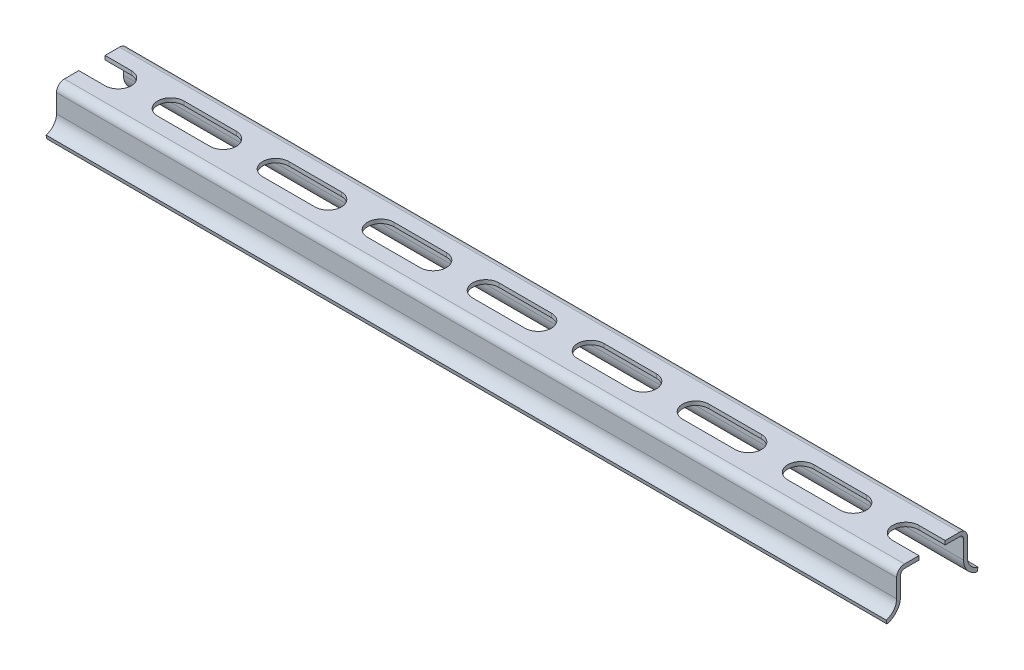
ISO-10303-21;
HEADER;
FILE_DESCRIPTION(('STEP AP214'),'2;1');
FILE_NAME('part.step','',(''),(''),'','','');
FILE_SCHEMA(('AUTOMOTIVE_DESIGN { 1 0 10303 214 1 1 1 1 }'));
ENDSEC;
DATA;
#1=APPLICATION_CONTEXT('core data for automotive mechanical design processes');
#2=APPLICATION_PROTOCOL_DEFINITION('international standard','automotive_design',2000,#1);
#3=PRODUCT_CONTEXT('',#1,'mechanical');
#4=PRODUCT('Part','Part','',(#3));
#5=PRODUCT_RELATED_PRODUCT_CATEGORY('part','',(#4));
#6=PRODUCT_DEFINITION_FORMATION('','',#4);
#7=PRODUCT_DEFINITION_CONTEXT('part definition',#1,'design');
#8=PRODUCT_DEFINITION('design','',#6,#7);
#9=PRODUCT_DEFINITION_SHAPE('','',#8);
#10=(LENGTH_UNIT() NAMED_UNIT(*) SI_UNIT(.MILLI.,.METRE.));
#11=(NAMED_UNIT(*) PLANE_ANGLE_UNIT() SI_UNIT($,.RADIAN.));
#12=(NAMED_UNIT(*) SI_UNIT($,.STERADIAN.) SOLID_ANGLE_UNIT());
#13=UNCERTAINTY_MEASURE_WITH_UNIT(LENGTH_MEASURE(1.E-05),#10,'distance_accuracy_value','');
#14=(GEOMETRIC_REPRESENTATION_CONTEXT(3) GLOBAL_UNCERTAINTY_ASSIGNED_CONTEXT((#13)) GLOBAL_UNIT_ASSIGNED_CONTEXT((#10,
#11,#12)) REPRESENTATION_CONTEXT('',''));
#15=CARTESIAN_POINT('',(0.,0.,0.));
#16=DIRECTION('',(0.,0.,1.));
#17=DIRECTION('',(1.,0.,0.));
#18=AXIS2_PLACEMENT_3D('',#15,#16,#17);
#19=CARTESIAN_POINT('',(160.,-15.,-17.5000000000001));
#20=DIRECTION('',(0.,0.219512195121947,0.975609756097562));
#21=DIRECTION('',(0.,-0.975609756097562,0.219512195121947));
#22=AXIS2_PLACEMENT_3D('',#19,#20,#21);
#23=PLANE('',#22);
#24=DIRECTION('',(-1.,0.,0.));
#25=VECTOR('',#24,1.);
#26=CARTESIAN_POINT('',(160.,-15.,-17.5000000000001));
#27=LINE('',#26,#25);
#28=CARTESIAN_POINT('',(-160.,-15.,-17.5));
#29=VERTEX_POINT('',#28);
#30=CARTESIAN_POINT('',(160.,-15.,-17.5000000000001));
#31=VERTEX_POINT('',#30);
#32=EDGE_CURVE('E607',#29,#31,#27,.F.);
#33=ORIENTED_EDGE('',*,*,#32,.T.);
#34=DIRECTION('',(0.,-0.975609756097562,0.219512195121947));
#35=VECTOR('',#34,1.);
#36=CARTESIAN_POINT('',(160.,-15.,-17.5000000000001));
#37=LINE('',#36,#35);
#38=CARTESIAN_POINT('',(160.,-16.4634146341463,-17.1707317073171));
#39=VERTEX_POINT('',#38);
#40=EDGE_CURVE('E392',#39,#31,#37,.F.);
#41=ORIENTED_EDGE('',*,*,#40,.F.);
#42=DIRECTION('',(-1.,0.,0.));
#43=VECTOR('',#42,1.);
#44=CARTESIAN_POINT('',(160.,-16.4634146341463,-17.1707317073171));
#45=LINE('',#44,#43);
#46=CARTESIAN_POINT('',(-160.,-16.4634146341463,-17.1707317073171));
#47=VERTEX_POINT('',#46);
#48=EDGE_CURVE('E611',#47,#39,#45,.F.);
#49=ORIENTED_EDGE('',*,*,#48,.F.);
#50=DIRECTION('',(0.,-0.975609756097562,0.219512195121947));
#51=VECTOR('',#50,1.);
#52=CARTESIAN_POINT('',(-160.,-15.,-17.5));
#53=LINE('',#52,#51);
#54=EDGE_CURVE('E388',#29,#47,#53,.T.);
#55=ORIENTED_EDGE('',*,*,#54,.F.);
#56=EDGE_LOOP('',(#33,#41,#49,#55));
#57=FACE_BOUND('',#56,.T.);
#58=ADVANCED_FACE('F26',(#57),#23,.F.);
#59=CARTESIAN_POINT('',(160.,-15.,17.4999999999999));
#60=DIRECTION('',(0.,0.219512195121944,-0.975609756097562));
#61=DIRECTION('',(0.,0.975609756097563,0.219512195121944));
#62=AXIS2_PLACEMENT_3D('',#59,#60,#61);
#63=PLANE('',#62);
#64=DIRECTION('',(-1.,0.,0.));
#65=VECTOR('',#64,1.);
#66=CARTESIAN_POINT('',(160.,-16.4634146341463,17.170731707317));
#67=LINE('',#66,#65);
#68=CARTESIAN_POINT('',(160.,-16.4634146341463,17.170731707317));
#69=VERTEX_POINT('',#68);
#70=CARTESIAN_POINT('',(-160.,-16.4634146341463,17.1707317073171));
#71=VERTEX_POINT('',#70);
#72=EDGE_CURVE('E583',#69,#71,#67,.T.);
#73=ORIENTED_EDGE('',*,*,#72,.F.);
#74=DIRECTION('',(0.,0.975609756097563,0.219512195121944));
#75=VECTOR('',#74,1.);
#76=CARTESIAN_POINT('',(160.,-15.,17.4999999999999));
#77=LINE('',#76,#75);
#78=CARTESIAN_POINT('',(160.,-15.,17.4999999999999));
#79=VERTEX_POINT('',#78);
#80=EDGE_CURVE('E385',#79,#69,#77,.F.);
#81=ORIENTED_EDGE('',*,*,#80,.F.);
#82=DIRECTION('',(-1.,0.,0.));
#83=VECTOR('',#82,1.);
#84=CARTESIAN_POINT('',(160.,-15.,17.4999999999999));
#85=LINE('',#84,#83);
#86=CARTESIAN_POINT('',(-160.,-15.,17.5));
#87=VERTEX_POINT('',#86);
#88=EDGE_CURVE('E586',#79,#87,#85,.T.);
#89=ORIENTED_EDGE('',*,*,#88,.T.);
#90=DIRECTION('',(0.,0.975609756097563,0.219512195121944));
#91=VECTOR('',#90,1.);
#92=CARTESIAN_POINT('',(-160.,-15.,17.5));
#93=LINE('',#92,#91);
#94=EDGE_CURVE('E387',#71,#87,#93,.T.);
#95=ORIENTED_EDGE('',*,*,#94,.F.);
#96=EDGE_LOOP('',(#73,#81,#89,#95));
#97=FACE_BOUND('',#96,.T.);
#98=ADVANCED_FACE('F1060',(#97),#63,.F.);
#99=CARTESIAN_POINT('',(160.,-3.,-10.5000000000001));
#100=DIRECTION('',(-1.,0.,0.));
#101=DIRECTION('',(0.,0.,1.));
#102=AXIS2_PLACEMENT_3D('',#99,#100,#101);
#103=CYLINDRICAL_SURFACE('',#102,1.5);
#104=DIRECTION('',(-1.,0.,0.));
#105=VECTOR('',#104,1.);
#106=CARTESIAN_POINT('',(160.,-2.99999999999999,-12.0000000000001));
#107=LINE('',#106,#105);
#108=CARTESIAN_POINT('',(-160.,-3.,-12.));
#109=VERTEX_POINT('',#108);
#110=CARTESIAN_POINT('',(160.,-2.99999999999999,-12.0000000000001));
#111=VERTEX_POINT('',#110);
#112=EDGE_CURVE('E390',#109,#111,#107,.F.);
#113=ORIENTED_EDGE('',*,*,#112,.T.);
#114=CARTESIAN_POINT('',(160.,-3.,-10.5000000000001));
#115=DIRECTION('',(-1.,0.,0.));
#116=DIRECTION('',(0.,0.,1.));
#117=AXIS2_PLACEMENT_3D('',#114,#115,#116);
#118=CIRCLE('',#117,1.5);
#119=CARTESIAN_POINT('',(160.,-1.49999999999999,-10.5000000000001));
#120=VERTEX_POINT('',#119);
#121=EDGE_CURVE('E484',#120,#111,#118,.T.);
#122=ORIENTED_EDGE('',*,*,#121,.F.);
#123=DIRECTION('',(1.,0.,0.));
#124=VECTOR('',#123,1.);
#125=CARTESIAN_POINT('',(160.,-1.49999999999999,-10.5000000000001));
#126=LINE('',#125,#124);
#127=CARTESIAN_POINT('',(-160.,-1.49999999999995,-10.5));
#128=VERTEX_POINT('',#127);
#129=EDGE_CURVE('E576',#120,#128,#126,.F.);
#130=ORIENTED_EDGE('',*,*,#129,.T.);
#131=CARTESIAN_POINT('',(-160.,-3.,-10.5));
#132=DIRECTION('',(-1.,0.,0.));
#133=DIRECTION('',(0.,0.,1.));
#134=AXIS2_PLACEMENT_3D('',#131,#132,#133);
#135=CIRCLE('',#134,1.5);
#136=EDGE_CURVE('E499',#128,#109,#135,.T.);
#137=ORIENTED_EDGE('',*,*,#136,.T.);
#138=EDGE_LOOP('',(#113,#122,#130,#137));
#139=FACE_BOUND('',#138,.T.);
#140=ADVANCED_FACE('F1057',(#139),#103,.F.);
#141=CARTESIAN_POINT('',(160.,-2.99999999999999,-12.0000000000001));
#142=DIRECTION('',(0.,0.,-1.));
#143=DIRECTION('',(-1.,0.,0.));
#144=AXIS2_PLACEMENT_3D('',#141,#142,#143);
#145=PLANE('',#144);
#146=DIRECTION('',(-1.,0.,0.));
#147=VECTOR('',#146,1.);
#148=CARTESIAN_POINT('',(160.,-9.99999999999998,-12.0000000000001));
#149=LINE('',#148,#147);
#150=CARTESIAN_POINT('',(160.,-9.99999999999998,-12.0000000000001));
#151=VERTEX_POINT('',#150);
#152=CARTESIAN_POINT('',(-160.,-9.99999999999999,-12.));
#153=VERTEX_POINT('',#152);
#154=EDGE_CURVE('E610',#151,#153,#149,.T.);
#155=ORIENTED_EDGE('',*,*,#154,.F.);
#156=DIRECTION('',(0.,1.,0.));
#157=VECTOR('',#156,1.);
#158=CARTESIAN_POINT('',(160.,-9.99999999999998,-12.0000000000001));
#159=LINE('',#158,#157);
#160=EDGE_CURVE('E483',#111,#151,#159,.F.);
#161=ORIENTED_EDGE('',*,*,#160,.F.);
#162=ORIENTED_EDGE('',*,*,#112,.F.);
#163=DIRECTION('',(0.,1.,0.));
#164=VECTOR('',#163,1.);
#165=CARTESIAN_POINT('',(-160.,-9.99999999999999,-12.));
#166=LINE('',#165,#164);
#167=EDGE_CURVE('E498',#109,#153,#166,.F.);
#168=ORIENTED_EDGE('',*,*,#167,.T.);
#169=EDGE_LOOP('',(#155,#161,#162,#168));
#170=FACE_BOUND('',#169,.T.);
#171=ADVANCED_FACE('F1053',(#170),#145,.F.);
#172=CARTESIAN_POINT('',(160.,-9.99999999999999,-18.6250000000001));
#173=DIRECTION('',(-1.,0.,0.));
#174=DIRECTION('',(0.,0.,1.));
#175=AXIS2_PLACEMENT_3D('',#172,#173,#174);
#176=CYLINDRICAL_SURFACE('',#175,6.62499999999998);
#177=CARTESIAN_POINT('',(160.,-9.99999999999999,-18.6250000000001));
#178=DIRECTION('',(-1.,0.,0.));
#179=DIRECTION('',(0.,0.,1.));
#180=AXIS2_PLACEMENT_3D('',#177,#178,#179);
#181=CIRCLE('',#180,6.62499999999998);
#182=EDGE_CURVE('E480',#151,#39,#181,.F.);
#183=ORIENTED_EDGE('',*,*,#182,.F.);
#184=ORIENTED_EDGE('',*,*,#154,.T.);
#185=CARTESIAN_POINT('',(-160.,-10.,-18.625));
#186=DIRECTION('',(-1.,0.,0.));
#187=DIRECTION('',(0.,0.,1.));
#188=AXIS2_PLACEMENT_3D('',#185,#186,#187);
#189=CIRCLE('',#188,6.62499999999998);
#190=EDGE_CURVE('E495',#153,#47,#189,.F.);
#191=ORIENTED_EDGE('',*,*,#190,.T.);
#192=ORIENTED_EDGE('',*,*,#48,.T.);
#193=EDGE_LOOP('',(#183,#184,#191,#192));
#194=FACE_BOUND('',#193,.T.);
#195=ADVANCED_FACE('F1049',(#194),#176,.T.);
#196=CARTESIAN_POINT('',(160.,-9.99999999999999,-18.6250000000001));
#197=DIRECTION('',(-1.,0.,0.));
#198=DIRECTION('',(0.,0.,1.));
#199=AXIS2_PLACEMENT_3D('',#196,#197,#198);
#200=CYLINDRICAL_SURFACE('',#199,5.12499999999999);
#201=DIRECTION('',(1.,0.,0.));
#202=VECTOR('',#201,1.);
#203=CARTESIAN_POINT('',(160.,-9.99999999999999,-13.5000000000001));
#204=LINE('',#203,#202);
#205=CARTESIAN_POINT('',(-160.,-9.99999999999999,-13.5));
#206=VERTEX_POINT('',#205);
#207=CARTESIAN_POINT('',(160.,-9.99999999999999,-13.5000000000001));
#208=VERTEX_POINT('',#207);
#209=EDGE_CURVE('E590',#206,#208,#204,.T.);
#210=ORIENTED_EDGE('',*,*,#209,.T.);
#211=CARTESIAN_POINT('',(160.,-9.99999999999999,-18.6250000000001));
#212=DIRECTION('',(-1.,0.,0.));
#213=DIRECTION('',(0.,0.,1.));
#214=AXIS2_PLACEMENT_3D('',#211,#212,#213);
#215=CIRCLE('',#214,5.12499999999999);
#216=EDGE_CURVE('E478',#31,#208,#215,.T.);
#217=ORIENTED_EDGE('',*,*,#216,.F.);
#218=ORIENTED_EDGE('',*,*,#32,.F.);
#219=CARTESIAN_POINT('',(-160.,-10.,-18.625));
#220=DIRECTION('',(-1.,0.,0.));
#221=DIRECTION('',(0.,0.,1.));
#222=AXIS2_PLACEMENT_3D('',#219,#220,#221);
#223=CIRCLE('',#222,5.12499999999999);
#224=EDGE_CURVE('E491',#29,#206,#223,.T.);
#225=ORIENTED_EDGE('',*,*,#224,.T.);
#226=EDGE_LOOP('',(#210,#217,#218,#225));
#227=FACE_BOUND('',#226,.T.);
#228=ADVANCED_FACE('F1045',(#227),#200,.F.);
#229=CARTESIAN_POINT('',(160.,-2.99999999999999,-13.5000000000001));
#230=DIRECTION('',(0.,0.,1.));
#231=DIRECTION('',(1.,0.,0.));
#232=AXIS2_PLACEMENT_3D('',#229,#230,#231);
#233=PLANE('',#232);
#234=DIRECTION('',(-1.,0.,0.));
#235=VECTOR('',#234,1.);
#236=CARTESIAN_POINT('',(160.,-2.99999999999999,-13.5000000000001));
#237=LINE('',#236,#235);
#238=CARTESIAN_POINT('',(160.,-2.99999999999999,-13.5000000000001));
#239=VERTEX_POINT('',#238);
#240=CARTESIAN_POINT('',(-160.,-3.,-13.5));
#241=VERTEX_POINT('',#240);
#242=EDGE_CURVE('E489',#239,#241,#237,.T.);
#243=ORIENTED_EDGE('',*,*,#242,.F.);
#244=DIRECTION('',(0.,1.,0.));
#245=VECTOR('',#244,1.);
#246=CARTESIAN_POINT('',(160.,-9.99999999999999,-13.5000000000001));
#247=LINE('',#246,#245);
#248=EDGE_CURVE('E477',#208,#239,#247,.T.);
#249=ORIENTED_EDGE('',*,*,#248,.F.);
#250=ORIENTED_EDGE('',*,*,#209,.F.);
#251=DIRECTION('',(0.,1.,0.));
#252=VECTOR('',#251,1.);
#253=CARTESIAN_POINT('',(-160.,-9.99999999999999,-13.5));
#254=LINE('',#253,#252);
#255=EDGE_CURVE('E494',#206,#241,#254,.T.);
#256=ORIENTED_EDGE('',*,*,#255,.T.);
#257=EDGE_LOOP('',(#243,#249,#250,#256));
#258=FACE_BOUND('',#257,.T.);
#259=ADVANCED_FACE('F1041',(#258),#233,.F.);
#260=CARTESIAN_POINT('',(160.,-3.00000000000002,13.4999999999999));
#261=DIRECTION('',(0.,0.,-1.));
#262=DIRECTION('',(-1.,0.,0.));
#263=AXIS2_PLACEMENT_3D('',#260,#261,#262);
#264=PLANE('',#263);
#265=DIRECTION('',(-1.,0.,0.));
#266=VECTOR('',#265,1.);
#267=CARTESIAN_POINT('',(160.,-10.,13.4999999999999));
#268=LINE('',#267,#266);
#269=CARTESIAN_POINT('',(-160.,-10.,13.5));
#270=VERTEX_POINT('',#269);
#271=CARTESIAN_POINT('',(160.,-10.,13.4999999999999));
#272=VERTEX_POINT('',#271);
#273=EDGE_CURVE('E587',#270,#272,#268,.F.);
#274=ORIENTED_EDGE('',*,*,#273,.T.);
#275=DIRECTION('',(0.,1.,0.));
#276=VECTOR('',#275,1.);
#277=CARTESIAN_POINT('',(160.,-10.,13.4999999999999));
#278=LINE('',#277,#276);
#279=CARTESIAN_POINT('',(160.,-3.,13.4999999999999));
#280=VERTEX_POINT('',#279);
#281=EDGE_CURVE('E466',#280,#272,#278,.F.);
#282=ORIENTED_EDGE('',*,*,#281,.F.);
#283=DIRECTION('',(-1.,0.,0.));
#284=VECTOR('',#283,1.);
#285=CARTESIAN_POINT('',(160.,-3.,13.4999999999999));
#286=LINE('',#285,#284);
#287=CARTESIAN_POINT('',(-160.,-3.00000000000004,13.5));
#288=VERTEX_POINT('',#287);
#289=EDGE_CURVE('E522',#288,#280,#286,.F.);
#290=ORIENTED_EDGE('',*,*,#289,.F.);
#291=DIRECTION('',(0.,1.,0.));
#292=VECTOR('',#291,1.);
#293=CARTESIAN_POINT('',(-160.,-10.,13.5));
#294=LINE('',#293,#292);
#295=EDGE_CURVE('E518',#288,#270,#294,.F.);
#296=ORIENTED_EDGE('',*,*,#295,.T.);
#297=EDGE_LOOP('',(#274,#282,#290,#296));
#298=FACE_BOUND('',#297,.T.);
#299=ADVANCED_FACE('F1037',(#298),#264,.F.);
#300=CARTESIAN_POINT('',(160.,-10.,18.6249999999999));
#301=DIRECTION('',(-1.,0.,0.));
#302=DIRECTION('',(0.,0.,1.));
#303=AXIS2_PLACEMENT_3D('',#300,#301,#302);
#304=CYLINDRICAL_SURFACE('',#303,5.12499999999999);
#305=ORIENTED_EDGE('',*,*,#88,.F.);
#306=CARTESIAN_POINT('',(160.,-10.,18.6249999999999));
#307=DIRECTION('',(-1.,0.,0.));
#308=DIRECTION('',(0.,0.,1.));
#309=AXIS2_PLACEMENT_3D('',#306,#307,#308);
#310=CIRCLE('',#309,5.12499999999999);
#311=EDGE_CURVE('E463',#272,#79,#310,.T.);
#312=ORIENTED_EDGE('',*,*,#311,.F.);
#313=ORIENTED_EDGE('',*,*,#273,.F.);
#314=CARTESIAN_POINT('',(-160.,-9.99999999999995,18.625));
#315=DIRECTION('',(-1.,0.,0.));
#316=DIRECTION('',(0.,0.,1.));
#317=AXIS2_PLACEMENT_3D('',#314,#315,#316);
#318=CIRCLE('',#317,5.12499999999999);
#319=EDGE_CURVE('E515',#270,#87,#318,.T.);
#320=ORIENTED_EDGE('',*,*,#319,.T.);
#321=EDGE_LOOP('',(#305,#312,#313,#320));
#322=FACE_BOUND('',#321,.T.);
#323=ADVANCED_FACE('F1033',(#322),#304,.F.);
#324=CARTESIAN_POINT('',(160.,-10.,18.6249999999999));
#325=DIRECTION('',(-1.,0.,0.));
#326=DIRECTION('',(0.,0.,1.));
#327=AXIS2_PLACEMENT_3D('',#324,#325,#326);
#328=CYLINDRICAL_SURFACE('',#327,6.62499999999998);
#329=CARTESIAN_POINT('',(160.,-10.,18.6249999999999));
#330=DIRECTION('',(-1.,0.,0.));
#331=DIRECTION('',(0.,0.,1.));
#332=AXIS2_PLACEMENT_3D('',#329,#330,#331);
#333=CIRCLE('',#332,6.62499999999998);
#334=CARTESIAN_POINT('',(160.,-10.,11.9999999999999));
#335=VERTEX_POINT('',#334);
#336=EDGE_CURVE('E461',#69,#335,#333,.F.);
#337=ORIENTED_EDGE('',*,*,#336,.F.);
#338=ORIENTED_EDGE('',*,*,#72,.T.);
#339=CARTESIAN_POINT('',(-160.,-9.99999999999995,18.625));
#340=DIRECTION('',(-1.,0.,0.));
#341=DIRECTION('',(0.,0.,1.));
#342=AXIS2_PLACEMENT_3D('',#339,#340,#341);
#343=CIRCLE('',#342,6.62499999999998);
#344=CARTESIAN_POINT('',(-160.,-10.,12.));
#345=VERTEX_POINT('',#344);
#346=EDGE_CURVE('E512',#71,#345,#343,.F.);
#347=ORIENTED_EDGE('',*,*,#346,.T.);
#348=DIRECTION('',(1.,0.,0.));
#349=VECTOR('',#348,1.);
#350=CARTESIAN_POINT('',(160.,-10.,11.9999999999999));
#351=LINE('',#350,#349);
#352=EDGE_CURVE('E580',#345,#335,#351,.T.);
#353=ORIENTED_EDGE('',*,*,#352,.T.);
#354=EDGE_LOOP('',(#337,#338,#347,#353));
#355=FACE_BOUND('',#354,.T.);
#356=ADVANCED_FACE('F1029',(#355),#328,.T.);
#357=CARTESIAN_POINT('',(160.,-3.00000000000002,11.9999999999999));
#358=DIRECTION('',(0.,0.,1.));
#359=DIRECTION('',(0.,-1.,0.));
#360=AXIS2_PLACEMENT_3D('',#357,#358,#359);
#361=PLANE('',#360);
#362=DIRECTION('',(-1.,0.,0.));
#363=VECTOR('',#362,1.);
#364=CARTESIAN_POINT('',(160.,-3.,11.9999999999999));
#365=LINE('',#364,#363);
#366=CARTESIAN_POINT('',(-160.,-3.00000000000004,12.));
#367=VERTEX_POINT('',#366);
#368=CARTESIAN_POINT('',(160.,-3.,11.9999999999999));
#369=VERTEX_POINT('',#368);
#370=EDGE_CURVE('E577',#367,#369,#365,.F.);
#371=ORIENTED_EDGE('',*,*,#370,.T.);
#372=DIRECTION('',(0.,1.,0.));
#373=VECTOR('',#372,1.);
#374=CARTESIAN_POINT('',(160.,-10.,11.9999999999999));
#375=LINE('',#374,#373);
#376=EDGE_CURVE('E460',#335,#369,#375,.T.);
#377=ORIENTED_EDGE('',*,*,#376,.F.);
#378=ORIENTED_EDGE('',*,*,#352,.F.);
#379=DIRECTION('',(0.,1.,0.));
#380=VECTOR('',#379,1.);
#381=CARTESIAN_POINT('',(-160.,-10.,12.));
#382=LINE('',#381,#380);
#383=EDGE_CURVE('E511',#345,#367,#382,.T.);
#384=ORIENTED_EDGE('',*,*,#383,.T.);
#385=EDGE_LOOP('',(#371,#377,#378,#384));
#386=FACE_BOUND('',#385,.T.);
#387=ADVANCED_FACE('F1025',(#386),#361,.F.);
#388=CARTESIAN_POINT('',(160.,-3.,10.4999999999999));
#389=DIRECTION('',(-1.,0.,0.));
#390=DIRECTION('',(0.,0.,1.));
#391=AXIS2_PLACEMENT_3D('',#388,#389,#390);
#392=CYLINDRICAL_SURFACE('',#391,1.5);
#393=DIRECTION('',(1.,0.,0.));
#394=VECTOR('',#393,1.);
#395=CARTESIAN_POINT('',(160.,-1.49999999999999,10.5));
#396=LINE('',#395,#394);
#397=CARTESIAN_POINT('',(-160.,-1.49999999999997,10.5));
#398=VERTEX_POINT('',#397);
#399=CARTESIAN_POINT('',(160.,-1.49999999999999,10.5));
#400=VERTEX_POINT('',#399);
#401=EDGE_CURVE('E362',#398,#400,#396,.T.);
#402=ORIENTED_EDGE('',*,*,#401,.T.);
#403=CARTESIAN_POINT('',(160.,-3.,10.4999999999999));
#404=DIRECTION('',(-1.,0.,0.));
#405=DIRECTION('',(0.,0.,1.));
#406=AXIS2_PLACEMENT_3D('',#403,#404,#405);
#407=CIRCLE('',#406,1.5);
#408=EDGE_CURVE('E458',#369,#400,#407,.T.);
#409=ORIENTED_EDGE('',*,*,#408,.F.);
#410=ORIENTED_EDGE('',*,*,#370,.F.);
#411=CARTESIAN_POINT('',(-160.,-3.00000000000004,10.5));
#412=DIRECTION('',(-1.,0.,0.));
#413=DIRECTION('',(0.,0.,1.));
#414=AXIS2_PLACEMENT_3D('',#411,#412,#413);
#415=CIRCLE('',#414,1.5);
#416=EDGE_CURVE('E507',#367,#398,#415,.T.);
#417=ORIENTED_EDGE('',*,*,#416,.T.);
#418=EDGE_LOOP('',(#402,#409,#410,#417));
#419=FACE_BOUND('',#418,.T.);
#420=ADVANCED_FACE('F1021',(#419),#392,.F.);
#421=CARTESIAN_POINT('',(160.,-1.49999999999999,10.4999999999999));
#422=DIRECTION('',(0.,1.,0.));
#423=DIRECTION('',(0.,0.,1.));
#424=AXIS2_PLACEMENT_3D('',#421,#422,#423);
#425=PLANE('',#424);
#426=DIRECTION('',(1.,0.,0.));
#427=VECTOR('',#426,1.);
#428=CARTESIAN_POINT('',(150.,-1.49999999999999,4.99999999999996));
#429=LINE('',#428,#427);
#430=CARTESIAN_POINT('',(150.,-1.49999999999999,4.99999999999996));
#431=VERTEX_POINT('',#430);
#432=CARTESIAN_POINT('',(160.,-1.5,4.99999999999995));
#433=VERTEX_POINT('',#432);
#434=EDGE_CURVE('E595',#431,#433,#429,.T.);
#435=ORIENTED_EDGE('',*,*,#434,.T.);
#436=DIRECTION('',(0.,0.,-1.));
#437=VECTOR('',#436,1.);
#438=CARTESIAN_POINT('',(160.,-1.5,-18.625));
#439=LINE('',#438,#437);
#440=EDGE_CURVE('E457',#400,#433,#439,.T.);
#441=ORIENTED_EDGE('',*,*,#440,.F.);
#442=ORIENTED_EDGE('',*,*,#401,.F.);
#443=DIRECTION('',(0.,0.,-1.));
#444=VECTOR('',#443,1.);
#445=CARTESIAN_POINT('',(-160.,-1.49999999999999,-18.625));
#446=LINE('',#445,#444);
#447=CARTESIAN_POINT('',(-160.,-1.49999999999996,5.00000000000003));
#448=VERTEX_POINT('',#447);
#449=EDGE_CURVE('E510',#398,#448,#446,.T.);
#450=ORIENTED_EDGE('',*,*,#449,.T.);
#451=DIRECTION('',(1.,0.,0.));
#452=VECTOR('',#451,1.);
#453=CARTESIAN_POINT('',(-170.,-1.5,5.));
#454=LINE('',#453,#452);
#455=CARTESIAN_POINT('',(-150.,-1.49999999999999,5.00000000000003));
#456=VERTEX_POINT('',#455);
#457=EDGE_CURVE('E622',#448,#456,#454,.T.);
#458=ORIENTED_EDGE('',*,*,#457,.T.);
#459=CARTESIAN_POINT('',(-150.,-1.49999999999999,0.));
#460=DIRECTION('',(0.,-1.,0.));
#461=DIRECTION('',(0.,0.,-1.));
#462=AXIS2_PLACEMENT_3D('',#459,#460,#461);
#463=CIRCLE('',#462,5.);
#464=CARTESIAN_POINT('',(-150.,-1.49999999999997,-4.99999999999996));
#465=VERTEX_POINT('',#464);
#466=EDGE_CURVE('E503',#456,#465,#463,.F.);
#467=ORIENTED_EDGE('',*,*,#466,.T.);
#468=DIRECTION('',(-1.,0.,0.));
#469=VECTOR('',#468,1.);
#470=CARTESIAN_POINT('',(-170.,-1.49999999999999,-4.99999999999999));
#471=LINE('',#470,#469);
#472=CARTESIAN_POINT('',(-160.,-1.49999999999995,-4.99999999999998));
#473=VERTEX_POINT('',#472);
#474=EDGE_CURVE('E502',#465,#473,#471,.T.);
#475=ORIENTED_EDGE('',*,*,#474,.T.);
#476=DIRECTION('',(0.,0.,-1.));
#477=VECTOR('',#476,1.);
#478=CARTESIAN_POINT('',(-160.,-1.49999999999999,-18.625));
#479=LINE('',#478,#477);
#480=EDGE_CURVE('E490',#473,#128,#479,.T.);
#481=ORIENTED_EDGE('',*,*,#480,.T.);
#482=ORIENTED_EDGE('',*,*,#129,.F.);
#483=DIRECTION('',(0.,0.,-1.));
#484=VECTOR('',#483,1.);
#485=CARTESIAN_POINT('',(160.,-1.5,-18.625));
#486=LINE('',#485,#484);
#487=CARTESIAN_POINT('',(160.,-1.49999999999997,-5.00000000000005));
#488=VERTEX_POINT('',#487);
#489=EDGE_CURVE('E486',#488,#120,#486,.T.);
#490=ORIENTED_EDGE('',*,*,#489,.F.);
#491=DIRECTION('',(-1.,0.,0.));
#492=VECTOR('',#491,1.);
#493=CARTESIAN_POINT('',(150.,-1.49999999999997,-5.00000000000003));
#494=LINE('',#493,#492);
#495=CARTESIAN_POINT('',(150.,-1.49999999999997,-5.00000000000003));
#496=VERTEX_POINT('',#495);
#497=EDGE_CURVE('E599',#488,#496,#494,.T.);
#498=ORIENTED_EDGE('',*,*,#497,.T.);
#499=CARTESIAN_POINT('',(150.,-1.49999999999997,0.));
#500=DIRECTION('',(0.,-1.,0.));
#501=DIRECTION('',(0.,0.,-1.));
#502=AXIS2_PLACEMENT_3D('',#499,#500,#501);
#503=CIRCLE('',#502,5.);
#504=EDGE_CURVE('E470',#496,#431,#503,.F.);
#505=ORIENTED_EDGE('',*,*,#504,.T.);
#506=EDGE_LOOP('',(#435,#441,#442,#450,#458,#467,#475,#481,#482,#490,#498,#505));
#507=FACE_BOUND('',#506,.T.);
#508=CARTESIAN_POINT('',(-9.99999999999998,-1.5,0.));
#509=DIRECTION('',(0.,-1.,0.));
#510=DIRECTION('',(0.,0.,-1.));
#511=AXIS2_PLACEMENT_3D('',#508,#509,#510);
#512=CIRCLE('',#511,5.);
#513=CARTESIAN_POINT('',(-9.99999999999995,-1.5,-5.));
#514=VERTEX_POINT('',#513);
#515=CARTESIAN_POINT('',(-10.,-1.5,4.99999999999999));
#516=VERTEX_POINT('',#515);
#517=EDGE_CURVE('E523',#514,#516,#512,.F.);
#518=ORIENTED_EDGE('',*,*,#517,.T.);
#519=DIRECTION('',(1.,0.,0.));
#520=VECTOR('',#519,1.);
#521=CARTESIAN_POINT('',(-10.,-1.5,4.99999999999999));
#522=LINE('',#521,#520);
#523=CARTESIAN_POINT('',(10.,-1.5,4.99999999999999));
#524=VERTEX_POINT('',#523);
#525=EDGE_CURVE('E627',#516,#524,#522,.T.);
#526=ORIENTED_EDGE('',*,*,#525,.T.);
#527=CARTESIAN_POINT('',(9.99999999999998,-1.5,0.));
#528=DIRECTION('',(0.,-1.,0.));
#529=DIRECTION('',(0.,0.,-1.));
#530=AXIS2_PLACEMENT_3D('',#527,#528,#529);
#531=CIRCLE('',#530,5.);
#532=CARTESIAN_POINT('',(10.,-1.5,-5.00000000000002));
#533=VERTEX_POINT('',#532);
#534=EDGE_CURVE('E527',#524,#533,#531,.F.);
#535=ORIENTED_EDGE('',*,*,#534,.T.);
#536=DIRECTION('',(-1.,0.,0.));
#537=VECTOR('',#536,1.);
#538=CARTESIAN_POINT('',(-9.99999999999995,-1.5,-5.));
#539=LINE('',#538,#537);
#540=EDGE_CURVE('E630',#533,#514,#539,.T.);
#541=ORIENTED_EDGE('',*,*,#540,.T.);
#542=EDGE_LOOP('',(#518,#526,#535,#541));
#543=FACE_BOUND('',#542,.T.);
#544=CARTESIAN_POINT('',(-50.,-1.49999999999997,0.));
#545=DIRECTION('',(0.,-1.,0.));
#546=DIRECTION('',(0.,0.,-1.));
#547=AXIS2_PLACEMENT_3D('',#544,#545,#546);
#548=CIRCLE('',#547,5.);
#549=CARTESIAN_POINT('',(-49.9999999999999,-1.5,-5.00000000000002));
#550=VERTEX_POINT('',#549);
#551=CARTESIAN_POINT('',(-50.,-1.49999999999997,4.99999999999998));
#552=VERTEX_POINT('',#551);
#553=EDGE_CURVE('E531',#550,#552,#548,.F.);
#554=ORIENTED_EDGE('',*,*,#553,.T.);
#555=DIRECTION('',(1.,0.,0.));
#556=VECTOR('',#555,1.);
#557=CARTESIAN_POINT('',(-50.,-1.49999999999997,4.99999999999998));
#558=LINE('',#557,#556);
#559=CARTESIAN_POINT('',(-30.,-1.5,5.));
#560=VERTEX_POINT('',#559);
#561=EDGE_CURVE('E632',#552,#560,#558,.T.);
#562=ORIENTED_EDGE('',*,*,#561,.T.);
#563=CARTESIAN_POINT('',(-30.,-1.5,0.));
#564=DIRECTION('',(0.,-1.,0.));
#565=DIRECTION('',(0.,0.,-1.));
#566=AXIS2_PLACEMENT_3D('',#563,#564,#565);
#567=CIRCLE('',#566,5.);
#568=CARTESIAN_POINT('',(-30.,-1.5,-4.99999999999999));
#569=VERTEX_POINT('',#568);
#570=EDGE_CURVE('E535',#560,#569,#567,.F.);
#571=ORIENTED_EDGE('',*,*,#570,.T.);
#572=DIRECTION('',(-1.,0.,0.));
#573=VECTOR('',#572,1.);
#574=CARTESIAN_POINT('',(-49.9999999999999,-1.5,-5.00000000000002));
#575=LINE('',#574,#573);
#576=EDGE_CURVE('E635',#569,#550,#575,.T.);
#577=ORIENTED_EDGE('',*,*,#576,.T.);
#578=EDGE_LOOP('',(#554,#562,#571,#577));
#579=FACE_BOUND('',#578,.T.);
#580=CARTESIAN_POINT('',(-90.,-1.49999999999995,0.));
#581=DIRECTION('',(0.,-1.,0.));
#582=DIRECTION('',(0.,0.,-1.));
#583=AXIS2_PLACEMENT_3D('',#580,#581,#582);
#584=CIRCLE('',#583,5.);
#585=CARTESIAN_POINT('',(-90.,-1.49999999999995,-4.99999999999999));
#586=VERTEX_POINT('',#585);
#587=CARTESIAN_POINT('',(-90.,-1.49999999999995,5.));
#588=VERTEX_POINT('',#587);
#589=EDGE_CURVE('E539',#586,#588,#584,.F.);
#590=ORIENTED_EDGE('',*,*,#589,.T.);
#591=DIRECTION('',(1.,0.,0.));
#592=VECTOR('',#591,1.);
#593=CARTESIAN_POINT('',(-90.,-1.49999999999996,5.));
#594=LINE('',#593,#592);
#595=CARTESIAN_POINT('',(-70.,-1.49999999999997,5.00000000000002));
#596=VERTEX_POINT('',#595);
#597=EDGE_CURVE('E637',#588,#596,#594,.T.);
#598=ORIENTED_EDGE('',*,*,#597,.T.);
#599=CARTESIAN_POINT('',(-70.0000000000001,-1.49999999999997,0.));
#600=DIRECTION('',(0.,-1.,0.));
#601=DIRECTION('',(0.,0.,-1.));
#602=AXIS2_PLACEMENT_3D('',#599,#600,#601);
#603=CIRCLE('',#602,5.);
#604=CARTESIAN_POINT('',(-70.,-1.50000000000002,-4.99999999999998));
#605=VERTEX_POINT('',#604);
#606=EDGE_CURVE('E543',#596,#605,#603,.F.);
#607=ORIENTED_EDGE('',*,*,#606,.T.);
#608=DIRECTION('',(-1.,0.,0.));
#609=VECTOR('',#608,1.);
#610=CARTESIAN_POINT('',(-90.,-1.49999999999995,-4.99999999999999));
#611=LINE('',#610,#609);
#612=EDGE_CURVE('E640',#605,#586,#611,.T.);
#613=ORIENTED_EDGE('',*,*,#612,.T.);
#614=EDGE_LOOP('',(#590,#598,#607,#613));
#615=FACE_BOUND('',#614,.T.);
#616=CARTESIAN_POINT('',(-130.,-1.49999999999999,0.));
#617=DIRECTION('',(0.,-1.,0.));
#618=DIRECTION('',(0.,0.,-1.));
#619=AXIS2_PLACEMENT_3D('',#616,#617,#618);
#620=CIRCLE('',#619,5.);
#621=CARTESIAN_POINT('',(-130.,-1.49999999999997,-4.99999999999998));
#622=VERTEX_POINT('',#621);
#623=CARTESIAN_POINT('',(-130.,-1.49999999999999,5.00000000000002));
#624=VERTEX_POINT('',#623);
#625=EDGE_CURVE('E547',#622,#624,#620,.F.);
#626=ORIENTED_EDGE('',*,*,#625,.T.);
#627=DIRECTION('',(1.,0.,0.));
#628=VECTOR('',#627,1.);
#629=CARTESIAN_POINT('',(-130.,-1.49999999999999,5.00000000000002));
#630=LINE('',#629,#628);
#631=CARTESIAN_POINT('',(-110.,-1.49999999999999,5.00000000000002));
#632=VERTEX_POINT('',#631);
#633=EDGE_CURVE('E642',#624,#632,#630,.T.);
#634=ORIENTED_EDGE('',*,*,#633,.T.);
#635=CARTESIAN_POINT('',(-110.,-1.5,0.));
#636=DIRECTION('',(0.,-1.,0.));
#637=DIRECTION('',(0.,0.,-1.));
#638=AXIS2_PLACEMENT_3D('',#635,#636,#637);
#639=CIRCLE('',#638,5.);
#640=CARTESIAN_POINT('',(-110.,-1.49999999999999,-4.99999999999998));
#641=VERTEX_POINT('',#640);
#642=EDGE_CURVE('E551',#632,#641,#639,.F.);
#643=ORIENTED_EDGE('',*,*,#642,.T.);
#644=DIRECTION('',(-1.,0.,0.));
#645=VECTOR('',#644,1.);
#646=CARTESIAN_POINT('',(-130.,-1.49999999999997,-4.99999999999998));
#647=LINE('',#646,#645);
#648=EDGE_CURVE('E645',#641,#622,#647,.T.);
#649=ORIENTED_EDGE('',*,*,#648,.T.);
#650=EDGE_LOOP('',(#626,#634,#643,#649));
#651=FACE_BOUND('',#650,.T.);
#652=CARTESIAN_POINT('',(30.,-1.5,0.));
#653=DIRECTION('',(0.,-1.,0.));
#654=DIRECTION('',(0.,0.,-1.));
#655=AXIS2_PLACEMENT_3D('',#652,#653,#654);
#656=CIRCLE('',#655,5.);
#657=CARTESIAN_POINT('',(30.,-1.49999999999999,-5.00000000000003));
#658=VERTEX_POINT('',#657);
#659=CARTESIAN_POINT('',(30.,-1.5,4.99999999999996));
#660=VERTEX_POINT('',#659);
#661=EDGE_CURVE('E555',#658,#660,#656,.F.);
#662=ORIENTED_EDGE('',*,*,#661,.T.);
#663=DIRECTION('',(1.,0.,0.));
#664=VECTOR('',#663,1.);
#665=CARTESIAN_POINT('',(30.,-1.5,4.99999999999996));
#666=LINE('',#665,#664);
#667=CARTESIAN_POINT('',(50.,-1.5,5.));
#668=VERTEX_POINT('',#667);
#669=EDGE_CURVE('E647',#660,#668,#666,.T.);
#670=ORIENTED_EDGE('',*,*,#669,.T.);
#671=CARTESIAN_POINT('',(50.,-1.49999999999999,0.));
#672=DIRECTION('',(0.,-1.,0.));
#673=DIRECTION('',(0.,0.,-1.));
#674=AXIS2_PLACEMENT_3D('',#671,#672,#673);
#675=CIRCLE('',#674,5.);
#676=CARTESIAN_POINT('',(50.,-1.49999999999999,-5.));
#677=VERTEX_POINT('',#676);
#678=EDGE_CURVE('E559',#668,#677,#675,.F.);
#679=ORIENTED_EDGE('',*,*,#678,.T.);
#680=DIRECTION('',(-1.,0.,0.));
#681=VECTOR('',#680,1.);
#682=CARTESIAN_POINT('',(30.,-1.49999999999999,-5.00000000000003));
#683=LINE('',#682,#681);
#684=EDGE_CURVE('E650',#677,#658,#683,.T.);
#685=ORIENTED_EDGE('',*,*,#684,.T.);
#686=EDGE_LOOP('',(#662,#670,#679,#685));
#687=FACE_BOUND('',#686,.T.);
#688=CARTESIAN_POINT('',(70.0000000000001,-1.5,0.));
#689=DIRECTION('',(0.,-1.,0.));
#690=DIRECTION('',(0.,0.,-1.));
#691=AXIS2_PLACEMENT_3D('',#688,#689,#690);
#692=CIRCLE('',#691,5.);
#693=CARTESIAN_POINT('',(70.,-1.5,-5.00000000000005));
#694=VERTEX_POINT('',#693);
#695=CARTESIAN_POINT('',(70.0000000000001,-1.5,4.99999999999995));
#696=VERTEX_POINT('',#695);
#697=EDGE_CURVE('E563',#694,#696,#692,.F.);
#698=ORIENTED_EDGE('',*,*,#697,.T.);
#699=DIRECTION('',(1.,0.,0.));
#700=VECTOR('',#699,1.);
#701=CARTESIAN_POINT('',(70.,-1.5,4.99999999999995));
#702=LINE('',#701,#700);
#703=CARTESIAN_POINT('',(90.,-1.49999999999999,4.99999999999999));
#704=VERTEX_POINT('',#703);
#705=EDGE_CURVE('E651',#696,#704,#702,.T.);
#706=ORIENTED_EDGE('',*,*,#705,.T.);
#707=CARTESIAN_POINT('',(90.,-1.5,0.));
#708=DIRECTION('',(0.,-1.,0.));
#709=DIRECTION('',(0.,0.,-1.));
#710=AXIS2_PLACEMENT_3D('',#707,#708,#709);
#711=CIRCLE('',#710,5.);
#712=CARTESIAN_POINT('',(90.,-1.5,-5.00000000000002));
#713=VERTEX_POINT('',#712);
#714=EDGE_CURVE('E370',#704,#713,#711,.F.);
#715=ORIENTED_EDGE('',*,*,#714,.T.);
#716=DIRECTION('',(-1.,0.,0.));
#717=VECTOR('',#716,1.);
#718=CARTESIAN_POINT('',(70.,-1.5,-5.00000000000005));
#719=LINE('',#718,#717);
#720=EDGE_CURVE('E380',#713,#694,#719,.T.);
#721=ORIENTED_EDGE('',*,*,#720,.T.);
#722=EDGE_LOOP('',(#698,#706,#715,#721));
#723=FACE_BOUND('',#722,.T.);
#724=CARTESIAN_POINT('',(110.,-1.5,0.));
#725=DIRECTION('',(0.,-1.,0.));
#726=DIRECTION('',(0.,0.,-1.));
#727=AXIS2_PLACEMENT_3D('',#724,#725,#726);
#728=CIRCLE('',#727,5.);
#729=CARTESIAN_POINT('',(110.,-1.5,-5.00000000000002));
#730=VERTEX_POINT('',#729);
#731=CARTESIAN_POINT('',(110.,-1.5,4.99999999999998));
#732=VERTEX_POINT('',#731);
#733=EDGE_CURVE('E374',#730,#732,#728,.F.);
#734=ORIENTED_EDGE('',*,*,#733,.T.);
#735=DIRECTION('',(1.,0.,0.));
#736=VECTOR('',#735,1.);
#737=CARTESIAN_POINT('',(110.,-1.5,4.99999999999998));
#738=LINE('',#737,#736);
#739=CARTESIAN_POINT('',(130.,-1.5,4.99999999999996));
#740=VERTEX_POINT('',#739);
#741=EDGE_CURVE('E366',#732,#740,#738,.T.);
#742=ORIENTED_EDGE('',*,*,#741,.T.);
#743=CARTESIAN_POINT('',(130.,-1.5,0.));
#744=DIRECTION('',(0.,-1.,0.));
#745=DIRECTION('',(0.,0.,-1.));
#746=AXIS2_PLACEMENT_3D('',#743,#744,#745);
#747=CIRCLE('',#746,5.);
#748=CARTESIAN_POINT('',(130.,-1.5,-5.00000000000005));
#749=VERTEX_POINT('',#748);
#750=EDGE_CURVE('E29',#740,#749,#747,.F.);
#751=ORIENTED_EDGE('',*,*,#750,.T.);
#752=DIRECTION('',(-1.,0.,0.));
#753=VECTOR('',#752,1.);
#754=CARTESIAN_POINT('',(110.,-1.5,-5.00000000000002));
#755=LINE('',#754,#753);
#756=EDGE_CURVE('E382',#749,#730,#755,.T.);
#757=ORIENTED_EDGE('',*,*,#756,.T.);
#758=EDGE_LOOP('',(#734,#742,#751,#757));
#759=FACE_BOUND('',#758,.T.);
#760=ADVANCED_FACE('F372',(#507,#543,#579,#615,#651,#687,#723,#759),#425,.F.);
#761=CARTESIAN_POINT('',(130.,8.50000000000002,0.));
#762=DIRECTION('',(0.,-1.,0.));
#763=DIRECTION('',(0.,0.,-1.));
#764=AXIS2_PLACEMENT_3D('',#761,#762,#763);
#765=CYLINDRICAL_SURFACE('',#764,5.);
#766=ORIENTED_EDGE('',*,*,#750,.F.);
#767=DIRECTION('',(0.,1.,0.));
#768=VECTOR('',#767,1.);
#769=CARTESIAN_POINT('',(130.,8.50000000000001,4.99999999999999));
#770=LINE('',#769,#768);
#771=CARTESIAN_POINT('',(130.,0.,4.99999999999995));
#772=VERTEX_POINT('',#771);
#773=EDGE_CURVE('E356',#740,#772,#770,.T.);
#774=ORIENTED_EDGE('',*,*,#773,.T.);
#775=CARTESIAN_POINT('',(130.,0.,0.));
#776=DIRECTION('',(0.,-1.,0.));
#777=DIRECTION('',(0.,0.,-1.));
#778=AXIS2_PLACEMENT_3D('',#775,#776,#777);
#779=CIRCLE('',#778,5.);
#780=CARTESIAN_POINT('',(130.,0.,-5.00000000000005));
#781=VERTEX_POINT('',#780);
#782=EDGE_CURVE('E455',#772,#781,#779,.F.);
#783=ORIENTED_EDGE('',*,*,#782,.T.);
#784=DIRECTION('',(0.,1.,0.));
#785=VECTOR('',#784,1.);
#786=CARTESIAN_POINT('',(130.,8.50000000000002,-5.00000000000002));
#787=LINE('',#786,#785);
#788=EDGE_CURVE('E358',#781,#749,#787,.F.);
#789=ORIENTED_EDGE('',*,*,#788,.T.);
#790=EDGE_LOOP('',(#766,#774,#783,#789));
#791=FACE_BOUND('',#790,.T.);
#792=ADVANCED_FACE('F354',(#791),#765,.F.);
#793=CARTESIAN_POINT('',(110.,8.49999999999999,-5.00000000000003));
#794=DIRECTION('',(0.,0.,-1.));
#795=DIRECTION('',(-1.,0.,0.));
#796=AXIS2_PLACEMENT_3D('',#793,#794,#795);
#797=PLANE('',#796);
#798=ORIENTED_EDGE('',*,*,#756,.F.);
#799=ORIENTED_EDGE('',*,*,#788,.F.);
#800=DIRECTION('',(1.,0.,0.));
#801=VECTOR('',#800,1.);
#802=CARTESIAN_POINT('',(160.,0.,-5.00000000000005));
#803=LINE('',#802,#801);
#804=CARTESIAN_POINT('',(110.,0.,-5.00000000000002));
#805=VERTEX_POINT('',#804);
#806=EDGE_CURVE('E454',#781,#805,#803,.F.);
#807=ORIENTED_EDGE('',*,*,#806,.T.);
#808=DIRECTION('',(0.,-1.,0.));
#809=VECTOR('',#808,1.);
#810=CARTESIAN_POINT('',(110.,8.49999999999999,-5.00000000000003));
#811=LINE('',#810,#809);
#812=EDGE_CURVE('E384',#805,#730,#811,.T.);
#813=ORIENTED_EDGE('',*,*,#812,.T.);
#814=EDGE_LOOP('',(#798,#799,#807,#813));
#815=FACE_BOUND('',#814,.T.);
#816=ADVANCED_FACE('F1013',(#815),#797,.F.);
#817=CARTESIAN_POINT('',(110.,8.49999999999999,0.));
#818=DIRECTION('',(0.,-1.,0.));
#819=DIRECTION('',(0.,0.,-1.));
#820=AXIS2_PLACEMENT_3D('',#817,#818,#819);
#821=CYLINDRICAL_SURFACE('',#820,5.);
#822=ORIENTED_EDGE('',*,*,#733,.F.);
#823=ORIENTED_EDGE('',*,*,#812,.F.);
#824=CARTESIAN_POINT('',(110.,0.,0.));
#825=DIRECTION('',(0.,-1.,0.));
#826=DIRECTION('',(0.,0.,-1.));
#827=AXIS2_PLACEMENT_3D('',#824,#825,#826);
#828=CIRCLE('',#827,5.);
#829=CARTESIAN_POINT('',(110.,0.,4.99999999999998));
#830=VERTEX_POINT('',#829);
#831=EDGE_CURVE('E451',#805,#830,#828,.F.);
#832=ORIENTED_EDGE('',*,*,#831,.T.);
#833=DIRECTION('',(0.,1.,0.));
#834=VECTOR('',#833,1.);
#835=CARTESIAN_POINT('',(110.,8.50000000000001,4.99999999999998));
#836=LINE('',#835,#834);
#837=EDGE_CURVE('E375',#830,#732,#836,.F.);
#838=ORIENTED_EDGE('',*,*,#837,.T.);
#839=EDGE_LOOP('',(#822,#823,#832,#838));
#840=FACE_BOUND('',#839,.T.);
#841=ADVANCED_FACE('F1010',(#840),#821,.F.);
#842=CARTESIAN_POINT('',(110.,8.50000000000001,4.99999999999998));
#843=DIRECTION('',(0.,0.,1.));
#844=DIRECTION('',(1.,0.,0.));
#845=AXIS2_PLACEMENT_3D('',#842,#843,#844);
#846=PLANE('',#845);
#847=ORIENTED_EDGE('',*,*,#741,.F.);
#848=ORIENTED_EDGE('',*,*,#837,.F.);
#849=DIRECTION('',(1.,0.,0.));
#850=VECTOR('',#849,1.);
#851=CARTESIAN_POINT('',(160.,0.,4.99999999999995));
#852=LINE('',#851,#850);
#853=EDGE_CURVE('E369',#830,#772,#852,.T.);
#854=ORIENTED_EDGE('',*,*,#853,.T.);
#855=ORIENTED_EDGE('',*,*,#773,.F.);
#856=EDGE_LOOP('',(#847,#848,#854,#855));
#857=FACE_BOUND('',#856,.T.);
#858=ADVANCED_FACE('F365',(#857),#846,.F.);
#859=CARTESIAN_POINT('',(90.,8.50000000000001,0.));
#860=DIRECTION('',(0.,-1.,0.));
#861=DIRECTION('',(0.,0.,-1.));
#862=AXIS2_PLACEMENT_3D('',#859,#860,#861);
#863=CYLINDRICAL_SURFACE('',#862,5.);
#864=ORIENTED_EDGE('',*,*,#714,.F.);
#865=DIRECTION('',(0.,1.,0.));
#866=VECTOR('',#865,1.);
#867=CARTESIAN_POINT('',(90.,8.50000000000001,4.99999999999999));
#868=LINE('',#867,#866);
#869=CARTESIAN_POINT('',(90.,0.,4.99999999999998));
#870=VERTEX_POINT('',#869);
#871=EDGE_CURVE('E562',#704,#870,#868,.T.);
#872=ORIENTED_EDGE('',*,*,#871,.T.);
#873=CARTESIAN_POINT('',(90.,0.,0.));
#874=DIRECTION('',(0.,-1.,0.));
#875=DIRECTION('',(0.,0.,-1.));
#876=AXIS2_PLACEMENT_3D('',#873,#874,#875);
#877=CIRCLE('',#876,5.);
#878=CARTESIAN_POINT('',(90.,0.,-5.00000000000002));
#879=VERTEX_POINT('',#878);
#880=EDGE_CURVE('E448',#870,#879,#877,.F.);
#881=ORIENTED_EDGE('',*,*,#880,.T.);
#882=DIRECTION('',(0.,1.,0.));
#883=VECTOR('',#882,1.);
#884=CARTESIAN_POINT('',(90.,8.50000000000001,-5.00000000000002));
#885=LINE('',#884,#883);
#886=EDGE_CURVE('E567',#879,#713,#885,.F.);
#887=ORIENTED_EDGE('',*,*,#886,.T.);
#888=EDGE_LOOP('',(#864,#872,#881,#887));
#889=FACE_BOUND('',#888,.T.);
#890=ADVANCED_FACE('F1005',(#889),#863,.F.);
#891=CARTESIAN_POINT('',(70.,8.50000000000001,-5.00000000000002));
#892=DIRECTION('',(0.,0.,-1.));
#893=DIRECTION('',(-1.,0.,0.));
#894=AXIS2_PLACEMENT_3D('',#891,#892,#893);
#895=PLANE('',#894);
#896=ORIENTED_EDGE('',*,*,#720,.F.);
#897=ORIENTED_EDGE('',*,*,#886,.F.);
#898=DIRECTION('',(1.,0.,0.));
#899=VECTOR('',#898,1.);
#900=CARTESIAN_POINT('',(160.,0.,-5.00000000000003));
#901=LINE('',#900,#899);
#902=CARTESIAN_POINT('',(70.,0.,-5.00000000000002));
#903=VERTEX_POINT('',#902);
#904=EDGE_CURVE('E447',#879,#903,#901,.F.);
#905=ORIENTED_EDGE('',*,*,#904,.T.);
#906=DIRECTION('',(0.,-1.,0.));
#907=VECTOR('',#906,1.);
#908=CARTESIAN_POINT('',(70.,8.50000000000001,-5.00000000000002));
#909=LINE('',#908,#907);
#910=EDGE_CURVE('E566',#903,#694,#909,.T.);
#911=ORIENTED_EDGE('',*,*,#910,.T.);
#912=EDGE_LOOP('',(#896,#897,#905,#911));
#913=FACE_BOUND('',#912,.T.);
#914=ADVANCED_FACE('F673',(#913),#895,.F.);
#915=CARTESIAN_POINT('',(70.,8.50000000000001,0.));
#916=DIRECTION('',(0.,-1.,0.));
#917=DIRECTION('',(0.,0.,-1.));
#918=AXIS2_PLACEMENT_3D('',#915,#916,#917);
#919=CYLINDRICAL_SURFACE('',#918,5.);
#920=ORIENTED_EDGE('',*,*,#697,.F.);
#921=ORIENTED_EDGE('',*,*,#910,.F.);
#922=CARTESIAN_POINT('',(70.,0.,0.));
#923=DIRECTION('',(0.,-1.,0.));
#924=DIRECTION('',(0.,0.,-1.));
#925=AXIS2_PLACEMENT_3D('',#922,#923,#924);
#926=CIRCLE('',#925,5.);
#927=CARTESIAN_POINT('',(70.,0.,4.99999999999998));
#928=VERTEX_POINT('',#927);
#929=EDGE_CURVE('E444',#903,#928,#926,.F.);
#930=ORIENTED_EDGE('',*,*,#929,.T.);
#931=DIRECTION('',(0.,1.,0.));
#932=VECTOR('',#931,1.);
#933=CARTESIAN_POINT('',(70.,8.49999999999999,4.99999999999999));
#934=LINE('',#933,#932);
#935=EDGE_CURVE('E565',#928,#696,#934,.F.);
#936=ORIENTED_EDGE('',*,*,#935,.T.);
#937=EDGE_LOOP('',(#920,#921,#930,#936));
#938=FACE_BOUND('',#937,.T.);
#939=ADVANCED_FACE('F670',(#938),#919,.F.);
#940=CARTESIAN_POINT('',(70.,8.49999999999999,4.99999999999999));
#941=DIRECTION('',(0.,0.,1.));
#942=DIRECTION('',(1.,0.,0.));
#943=AXIS2_PLACEMENT_3D('',#940,#941,#942);
#944=PLANE('',#943);
#945=ORIENTED_EDGE('',*,*,#705,.F.);
#946=ORIENTED_EDGE('',*,*,#935,.F.);
#947=DIRECTION('',(1.,0.,0.));
#948=VECTOR('',#947,1.);
#949=CARTESIAN_POINT('',(160.,0.,4.99999999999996));
#950=LINE('',#949,#948);
#951=EDGE_CURVE('E443',#928,#870,#950,.T.);
#952=ORIENTED_EDGE('',*,*,#951,.T.);
#953=ORIENTED_EDGE('',*,*,#871,.F.);
#954=EDGE_LOOP('',(#945,#946,#952,#953));
#955=FACE_BOUND('',#954,.T.);
#956=ADVANCED_FACE('F996',(#955),#944,.F.);
#957=CARTESIAN_POINT('',(50.,8.49999999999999,0.));
#958=DIRECTION('',(0.,-1.,0.));
#959=DIRECTION('',(0.,0.,-1.));
#960=AXIS2_PLACEMENT_3D('',#957,#958,#959);
#961=CYLINDRICAL_SURFACE('',#960,5.);
#962=ORIENTED_EDGE('',*,*,#678,.F.);
#963=DIRECTION('',(0.,1.,0.));
#964=VECTOR('',#963,1.);
#965=CARTESIAN_POINT('',(50.,8.50000000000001,4.99999999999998));
#966=LINE('',#965,#964);
#967=CARTESIAN_POINT('',(50.,0.,4.99999999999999));
#968=VERTEX_POINT('',#967);
#969=EDGE_CURVE('E554',#668,#968,#966,.T.);
#970=ORIENTED_EDGE('',*,*,#969,.T.);
#971=CARTESIAN_POINT('',(50.,0.,0.));
#972=DIRECTION('',(0.,-1.,0.));
#973=DIRECTION('',(0.,0.,-1.));
#974=AXIS2_PLACEMENT_3D('',#971,#972,#973);
#975=CIRCLE('',#974,5.);
#976=CARTESIAN_POINT('',(50.,0.,-5.));
#977=VERTEX_POINT('',#976);
#978=EDGE_CURVE('E440',#968,#977,#975,.F.);
#979=ORIENTED_EDGE('',*,*,#978,.T.);
#980=DIRECTION('',(0.,1.,0.));
#981=VECTOR('',#980,1.);
#982=CARTESIAN_POINT('',(50.,8.49999999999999,-5.00000000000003));
#983=LINE('',#982,#981);
#984=EDGE_CURVE('E561',#977,#677,#983,.F.);
#985=ORIENTED_EDGE('',*,*,#984,.T.);
#986=EDGE_LOOP('',(#962,#970,#979,#985));
#987=FACE_BOUND('',#986,.T.);
#988=ADVANCED_FACE('F993',(#987),#961,.F.);
#989=CARTESIAN_POINT('',(30.0000000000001,8.50000000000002,-5.00000000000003));
#990=DIRECTION('',(0.,0.,-1.));
#991=DIRECTION('',(-1.,0.,0.));
#992=AXIS2_PLACEMENT_3D('',#989,#990,#991);
#993=PLANE('',#992);
#994=ORIENTED_EDGE('',*,*,#684,.F.);
#995=ORIENTED_EDGE('',*,*,#984,.F.);
#996=DIRECTION('',(1.,0.,0.));
#997=VECTOR('',#996,1.);
#998=CARTESIAN_POINT('',(160.,0.,-5.00000000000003));
#999=LINE('',#998,#997);
#1000=CARTESIAN_POINT('',(30.,0.,-5.00000000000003));
#1001=VERTEX_POINT('',#1000);
#1002=EDGE_CURVE('E439',#977,#1001,#999,.F.);
#1003=ORIENTED_EDGE('',*,*,#1002,.T.);
#1004=DIRECTION('',(0.,-1.,0.));
#1005=VECTOR('',#1004,1.);
#1006=CARTESIAN_POINT('',(30.,8.50000000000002,-5.00000000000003));
#1007=LINE('',#1006,#1005);
#1008=EDGE_CURVE('E558',#1001,#658,#1007,.T.);
#1009=ORIENTED_EDGE('',*,*,#1008,.T.);
#1010=EDGE_LOOP('',(#994,#995,#1003,#1009));
#1011=FACE_BOUND('',#1010,.T.);
#1012=ADVANCED_FACE('F793',(#1011),#993,.F.);
#1013=CARTESIAN_POINT('',(30.0000000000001,8.50000000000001,0.));
#1014=DIRECTION('',(0.,-1.,0.));
#1015=DIRECTION('',(0.,0.,-1.));
#1016=AXIS2_PLACEMENT_3D('',#1013,#1014,#1015);
#1017=CYLINDRICAL_SURFACE('',#1016,5.);
#1018=ORIENTED_EDGE('',*,*,#661,.F.);
#1019=ORIENTED_EDGE('',*,*,#1008,.F.);
#1020=CARTESIAN_POINT('',(30.,0.,0.));
#1021=DIRECTION('',(0.,-1.,0.));
#1022=DIRECTION('',(0.,0.,-1.));
#1023=AXIS2_PLACEMENT_3D('',#1020,#1021,#1022);
#1024=CIRCLE('',#1023,5.);
#1025=CARTESIAN_POINT('',(30.,0.,4.99999999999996));
#1026=VERTEX_POINT('',#1025);
#1027=EDGE_CURVE('E436',#1001,#1026,#1024,.F.);
#1028=ORIENTED_EDGE('',*,*,#1027,.T.);
#1029=DIRECTION('',(0.,1.,0.));
#1030=VECTOR('',#1029,1.);
#1031=CARTESIAN_POINT('',(30.0000000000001,8.50000000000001,4.99999999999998));
#1032=LINE('',#1031,#1030);
#1033=EDGE_CURVE('E557',#1026,#660,#1032,.F.);
#1034=ORIENTED_EDGE('',*,*,#1033,.T.);
#1035=EDGE_LOOP('',(#1018,#1019,#1028,#1034));
#1036=FACE_BOUND('',#1035,.T.);
#1037=ADVANCED_FACE('F799',(#1036),#1017,.F.);
#1038=CARTESIAN_POINT('',(30.0000000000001,8.50000000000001,4.99999999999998));
#1039=DIRECTION('',(0.,0.,1.));
#1040=DIRECTION('',(1.,0.,0.));
#1041=AXIS2_PLACEMENT_3D('',#1038,#1039,#1040);
#1042=PLANE('',#1041);
#1043=ORIENTED_EDGE('',*,*,#669,.F.);
#1044=ORIENTED_EDGE('',*,*,#1033,.F.);
#1045=DIRECTION('',(1.,0.,0.));
#1046=VECTOR('',#1045,1.);
#1047=CARTESIAN_POINT('',(160.,0.,4.99999999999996));
#1048=LINE('',#1047,#1046);
#1049=EDGE_CURVE('E435',#1026,#968,#1048,.T.);
#1050=ORIENTED_EDGE('',*,*,#1049,.T.);
#1051=ORIENTED_EDGE('',*,*,#969,.F.);
#1052=EDGE_LOOP('',(#1043,#1044,#1050,#1051));
#1053=FACE_BOUND('',#1052,.T.);
#1054=ADVANCED_FACE('F985',(#1053),#1042,.F.);
#1055=CARTESIAN_POINT('',(-110.,8.50000000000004,0.));
#1056=DIRECTION('',(0.,-1.,0.));
#1057=DIRECTION('',(0.,0.,-1.));
#1058=AXIS2_PLACEMENT_3D('',#1055,#1056,#1057);
#1059=CYLINDRICAL_SURFACE('',#1058,5.);
#1060=ORIENTED_EDGE('',*,*,#642,.F.);
#1061=DIRECTION('',(0.,1.,0.));
#1062=VECTOR('',#1061,1.);
#1063=CARTESIAN_POINT('',(-110.,8.50000000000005,5.00000000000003));
#1064=LINE('',#1063,#1062);
#1065=CARTESIAN_POINT('',(-110.,0.,5.00000000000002));
#1066=VERTEX_POINT('',#1065);
#1067=EDGE_CURVE('E546',#632,#1066,#1064,.T.);
#1068=ORIENTED_EDGE('',*,*,#1067,.T.);
#1069=CARTESIAN_POINT('',(-110.,0.,0.));
#1070=DIRECTION('',(0.,-1.,0.));
#1071=DIRECTION('',(0.,0.,-1.));
#1072=AXIS2_PLACEMENT_3D('',#1069,#1070,#1071);
#1073=CIRCLE('',#1072,5.);
#1074=CARTESIAN_POINT('',(-110.,0.,-4.99999999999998));
#1075=VERTEX_POINT('',#1074);
#1076=EDGE_CURVE('E432',#1066,#1075,#1073,.F.);
#1077=ORIENTED_EDGE('',*,*,#1076,.T.);
#1078=DIRECTION('',(0.,1.,0.));
#1079=VECTOR('',#1078,1.);
#1080=CARTESIAN_POINT('',(-110.,8.50000000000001,-4.99999999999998));
#1081=LINE('',#1080,#1079);
#1082=EDGE_CURVE('E553',#1075,#641,#1081,.F.);
#1083=ORIENTED_EDGE('',*,*,#1082,.T.);
#1084=EDGE_LOOP('',(#1060,#1068,#1077,#1083));
#1085=FACE_BOUND('',#1084,.T.);
#1086=ADVANCED_FACE('F981',(#1085),#1059,.F.);
#1087=CARTESIAN_POINT('',(-130.,8.50000000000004,-4.99999999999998));
#1088=DIRECTION('',(0.,0.,-1.));
#1089=DIRECTION('',(-1.,0.,0.));
#1090=AXIS2_PLACEMENT_3D('',#1087,#1088,#1089);
#1091=PLANE('',#1090);
#1092=ORIENTED_EDGE('',*,*,#648,.F.);
#1093=ORIENTED_EDGE('',*,*,#1082,.F.);
#1094=DIRECTION('',(1.,0.,0.));
#1095=VECTOR('',#1094,1.);
#1096=CARTESIAN_POINT('',(160.,0.,-5.));
#1097=LINE('',#1096,#1095);
#1098=CARTESIAN_POINT('',(-130.,0.,-4.99999999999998));
#1099=VERTEX_POINT('',#1098);
#1100=EDGE_CURVE('E431',#1075,#1099,#1097,.F.);
#1101=ORIENTED_EDGE('',*,*,#1100,.T.);
#1102=DIRECTION('',(0.,-1.,0.));
#1103=VECTOR('',#1102,1.);
#1104=CARTESIAN_POINT('',(-130.,8.50000000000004,-4.99999999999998));
#1105=LINE('',#1104,#1103);
#1106=EDGE_CURVE('E550',#1099,#622,#1105,.T.);
#1107=ORIENTED_EDGE('',*,*,#1106,.T.);
#1108=EDGE_LOOP('',(#1092,#1093,#1101,#1107));
#1109=FACE_BOUND('',#1108,.T.);
#1110=ADVANCED_FACE('F977',(#1109),#1091,.F.);
#1111=CARTESIAN_POINT('',(-130.,8.50000000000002,0.));
#1112=DIRECTION('',(0.,-1.,0.));
#1113=DIRECTION('',(0.,0.,-1.));
#1114=AXIS2_PLACEMENT_3D('',#1111,#1112,#1113);
#1115=CYLINDRICAL_SURFACE('',#1114,5.);
#1116=ORIENTED_EDGE('',*,*,#625,.F.);
#1117=ORIENTED_EDGE('',*,*,#1106,.F.);
#1118=CARTESIAN_POINT('',(-130.,0.,0.));
#1119=DIRECTION('',(0.,-1.,0.));
#1120=DIRECTION('',(0.,0.,-1.));
#1121=AXIS2_PLACEMENT_3D('',#1118,#1119,#1120);
#1122=CIRCLE('',#1121,5.);
#1123=CARTESIAN_POINT('',(-130.,0.,5.00000000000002));
#1124=VERTEX_POINT('',#1123);
#1125=EDGE_CURVE('E428',#1099,#1124,#1122,.F.);
#1126=ORIENTED_EDGE('',*,*,#1125,.T.);
#1127=DIRECTION('',(0.,1.,0.));
#1128=VECTOR('',#1127,1.);
#1129=CARTESIAN_POINT('',(-130.,8.50000000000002,5.00000000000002));
#1130=LINE('',#1129,#1128);
#1131=EDGE_CURVE('E549',#1124,#624,#1130,.F.);
#1132=ORIENTED_EDGE('',*,*,#1131,.T.);
#1133=EDGE_LOOP('',(#1116,#1117,#1126,#1132));
#1134=FACE_BOUND('',#1133,.T.);
#1135=ADVANCED_FACE('F973',(#1134),#1115,.F.);
#1136=CARTESIAN_POINT('',(-130.,8.50000000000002,5.00000000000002));
#1137=DIRECTION('',(0.,0.,1.));
#1138=DIRECTION('',(1.,0.,0.));
#1139=AXIS2_PLACEMENT_3D('',#1136,#1137,#1138);
#1140=PLANE('',#1139);
#1141=ORIENTED_EDGE('',*,*,#633,.F.);
#1142=ORIENTED_EDGE('',*,*,#1131,.F.);
#1143=DIRECTION('',(1.,0.,0.));
#1144=VECTOR('',#1143,1.);
#1145=CARTESIAN_POINT('',(160.,0.,5.));
#1146=LINE('',#1145,#1144);
#1147=EDGE_CURVE('E427',#1124,#1066,#1146,.T.);
#1148=ORIENTED_EDGE('',*,*,#1147,.T.);
#1149=ORIENTED_EDGE('',*,*,#1067,.F.);
#1150=EDGE_LOOP('',(#1141,#1142,#1148,#1149));
#1151=FACE_BOUND('',#1150,.T.);
#1152=ADVANCED_FACE('F969',(#1151),#1140,.F.);
#1153=CARTESIAN_POINT('',(-70.,8.49999999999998,0.));
#1154=DIRECTION('',(0.,-1.,0.));
#1155=DIRECTION('',(0.,0.,-1.));
#1156=AXIS2_PLACEMENT_3D('',#1153,#1154,#1155);
#1157=CYLINDRICAL_SURFACE('',#1156,5.);
#1158=ORIENTED_EDGE('',*,*,#606,.F.);
#1159=DIRECTION('',(0.,1.,0.));
#1160=VECTOR('',#1159,1.);
#1161=CARTESIAN_POINT('',(-70.,8.49999999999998,5.00000000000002));
#1162=LINE('',#1161,#1160);
#1163=CARTESIAN_POINT('',(-70.,0.,5.00000000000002));
#1164=VERTEX_POINT('',#1163);
#1165=EDGE_CURVE('E538',#596,#1164,#1162,.T.);
#1166=ORIENTED_EDGE('',*,*,#1165,.T.);
#1167=CARTESIAN_POINT('',(-70.,0.,0.));
#1168=DIRECTION('',(0.,-1.,0.));
#1169=DIRECTION('',(0.,0.,-1.));
#1170=AXIS2_PLACEMENT_3D('',#1167,#1168,#1169);
#1171=CIRCLE('',#1170,5.);
#1172=CARTESIAN_POINT('',(-70.,0.,-4.99999999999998));
#1173=VERTEX_POINT('',#1172);
#1174=EDGE_CURVE('E424',#1164,#1173,#1171,.F.);
#1175=ORIENTED_EDGE('',*,*,#1174,.T.);
#1176=DIRECTION('',(0.,1.,0.));
#1177=VECTOR('',#1176,1.);
#1178=CARTESIAN_POINT('',(-70.,8.49999999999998,-4.99999999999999));
#1179=LINE('',#1178,#1177);
#1180=EDGE_CURVE('E545',#1173,#605,#1179,.F.);
#1181=ORIENTED_EDGE('',*,*,#1180,.T.);
#1182=EDGE_LOOP('',(#1158,#1166,#1175,#1181));
#1183=FACE_BOUND('',#1182,.T.);
#1184=ADVANCED_FACE('F965',(#1183),#1157,.F.);
#1185=CARTESIAN_POINT('',(-90.,8.50000000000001,-4.99999999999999));
#1186=DIRECTION('',(0.,0.,-1.));
#1187=DIRECTION('',(-1.,0.,0.));
#1188=AXIS2_PLACEMENT_3D('',#1185,#1186,#1187);
#1189=PLANE('',#1188);
#1190=ORIENTED_EDGE('',*,*,#612,.F.);
#1191=ORIENTED_EDGE('',*,*,#1180,.F.);
#1192=DIRECTION('',(1.,0.,0.));
#1193=VECTOR('',#1192,1.);
#1194=CARTESIAN_POINT('',(160.,0.,-5.));
#1195=LINE('',#1194,#1193);
#1196=CARTESIAN_POINT('',(-89.9999999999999,0.,-5.));
#1197=VERTEX_POINT('',#1196);
#1198=EDGE_CURVE('E423',#1173,#1197,#1195,.F.);
#1199=ORIENTED_EDGE('',*,*,#1198,.T.);
#1200=DIRECTION('',(0.,-1.,0.));
#1201=VECTOR('',#1200,1.);
#1202=CARTESIAN_POINT('',(-90.,8.50000000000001,-4.99999999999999));
#1203=LINE('',#1202,#1201);
#1204=EDGE_CURVE('E542',#1197,#586,#1203,.T.);
#1205=ORIENTED_EDGE('',*,*,#1204,.T.);
#1206=EDGE_LOOP('',(#1190,#1191,#1199,#1205));
#1207=FACE_BOUND('',#1206,.T.);
#1208=ADVANCED_FACE('F961',(#1207),#1189,.F.);
#1209=CARTESIAN_POINT('',(-90.,8.50000000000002,0.));
#1210=DIRECTION('',(0.,-1.,0.));
#1211=DIRECTION('',(0.,0.,-1.));
#1212=AXIS2_PLACEMENT_3D('',#1209,#1210,#1211);
#1213=CYLINDRICAL_SURFACE('',#1212,5.);
#1214=ORIENTED_EDGE('',*,*,#589,.F.);
#1215=ORIENTED_EDGE('',*,*,#1204,.F.);
#1216=CARTESIAN_POINT('',(-89.9999999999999,0.,0.));
#1217=DIRECTION('',(0.,-1.,0.));
#1218=DIRECTION('',(0.,0.,-1.));
#1219=AXIS2_PLACEMENT_3D('',#1216,#1217,#1218);
#1220=CIRCLE('',#1219,5.);
#1221=CARTESIAN_POINT('',(-89.9999999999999,0.,4.99999999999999));
#1222=VERTEX_POINT('',#1221);
#1223=EDGE_CURVE('E420',#1197,#1222,#1220,.F.);
#1224=ORIENTED_EDGE('',*,*,#1223,.T.);
#1225=DIRECTION('',(0.,1.,0.));
#1226=VECTOR('',#1225,1.);
#1227=CARTESIAN_POINT('',(-89.9999999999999,8.50000000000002,5.));
#1228=LINE('',#1227,#1226);
#1229=EDGE_CURVE('E541',#1222,#588,#1228,.F.);
#1230=ORIENTED_EDGE('',*,*,#1229,.T.);
#1231=EDGE_LOOP('',(#1214,#1215,#1224,#1230));
#1232=FACE_BOUND('',#1231,.T.);
#1233=ADVANCED_FACE('F957',(#1232),#1213,.F.);
#1234=CARTESIAN_POINT('',(-89.9999999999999,8.50000000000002,5.));
#1235=DIRECTION('',(0.,0.,1.));
#1236=DIRECTION('',(1.,0.,0.));
#1237=AXIS2_PLACEMENT_3D('',#1234,#1235,#1236);
#1238=PLANE('',#1237);
#1239=ORIENTED_EDGE('',*,*,#597,.F.);
#1240=ORIENTED_EDGE('',*,*,#1229,.F.);
#1241=DIRECTION('',(1.,0.,0.));
#1242=VECTOR('',#1241,1.);
#1243=CARTESIAN_POINT('',(160.,0.,4.99999999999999));
#1244=LINE('',#1243,#1242);
#1245=EDGE_CURVE('E419',#1222,#1164,#1244,.T.);
#1246=ORIENTED_EDGE('',*,*,#1245,.T.);
#1247=ORIENTED_EDGE('',*,*,#1165,.F.);
#1248=EDGE_LOOP('',(#1239,#1240,#1246,#1247));
#1249=FACE_BOUND('',#1248,.T.);
#1250=ADVANCED_FACE('F953',(#1249),#1238,.F.);
#1251=CARTESIAN_POINT('',(-30.,8.50000000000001,0.));
#1252=DIRECTION('',(0.,-1.,0.));
#1253=DIRECTION('',(0.,0.,-1.));
#1254=AXIS2_PLACEMENT_3D('',#1251,#1252,#1253);
#1255=CYLINDRICAL_SURFACE('',#1254,5.);
#1256=ORIENTED_EDGE('',*,*,#570,.F.);
#1257=DIRECTION('',(0.,1.,0.));
#1258=VECTOR('',#1257,1.);
#1259=CARTESIAN_POINT('',(-30.,8.50000000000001,4.99999999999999));
#1260=LINE('',#1259,#1258);
#1261=CARTESIAN_POINT('',(-30.,0.,5.));
#1262=VERTEX_POINT('',#1261);
#1263=EDGE_CURVE('E530',#560,#1262,#1260,.T.);
#1264=ORIENTED_EDGE('',*,*,#1263,.T.);
#1265=CARTESIAN_POINT('',(-30.,0.,0.));
#1266=DIRECTION('',(0.,-1.,0.));
#1267=DIRECTION('',(0.,0.,-1.));
#1268=AXIS2_PLACEMENT_3D('',#1265,#1266,#1267);
#1269=CIRCLE('',#1268,5.);
#1270=CARTESIAN_POINT('',(-30.,0.,-4.99999999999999));
#1271=VERTEX_POINT('',#1270);
#1272=EDGE_CURVE('E416',#1262,#1271,#1269,.F.);
#1273=ORIENTED_EDGE('',*,*,#1272,.T.);
#1274=DIRECTION('',(0.,1.,0.));
#1275=VECTOR('',#1274,1.);
#1276=CARTESIAN_POINT('',(-30.,8.50000000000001,-5.00000000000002));
#1277=LINE('',#1276,#1275);
#1278=EDGE_CURVE('E537',#1271,#569,#1277,.F.);
#1279=ORIENTED_EDGE('',*,*,#1278,.T.);
#1280=EDGE_LOOP('',(#1256,#1264,#1273,#1279));
#1281=FACE_BOUND('',#1280,.T.);
#1282=ADVANCED_FACE('F949',(#1281),#1255,.F.);
#1283=CARTESIAN_POINT('',(-50.,8.50000000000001,-4.99999999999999));
#1284=DIRECTION('',(0.,0.,-1.));
#1285=DIRECTION('',(-1.,0.,0.));
#1286=AXIS2_PLACEMENT_3D('',#1283,#1284,#1285);
#1287=PLANE('',#1286);
#1288=ORIENTED_EDGE('',*,*,#576,.F.);
#1289=ORIENTED_EDGE('',*,*,#1278,.F.);
#1290=DIRECTION('',(1.,0.,0.));
#1291=VECTOR('',#1290,1.);
#1292=CARTESIAN_POINT('',(160.,0.,-5.00000000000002));
#1293=LINE('',#1292,#1291);
#1294=CARTESIAN_POINT('',(-50.,0.,-5.00000000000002));
#1295=VERTEX_POINT('',#1294);
#1296=EDGE_CURVE('E415',#1271,#1295,#1293,.F.);
#1297=ORIENTED_EDGE('',*,*,#1296,.T.);
#1298=DIRECTION('',(0.,-1.,0.));
#1299=VECTOR('',#1298,1.);
#1300=CARTESIAN_POINT('',(-50.,8.50000000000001,-4.99999999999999));
#1301=LINE('',#1300,#1299);
#1302=EDGE_CURVE('E534',#1295,#550,#1301,.T.);
#1303=ORIENTED_EDGE('',*,*,#1302,.T.);
#1304=EDGE_LOOP('',(#1288,#1289,#1297,#1303));
#1305=FACE_BOUND('',#1304,.T.);
#1306=ADVANCED_FACE('F945',(#1305),#1287,.F.);
#1307=CARTESIAN_POINT('',(-50.,8.50000000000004,0.));
#1308=DIRECTION('',(0.,-1.,0.));
#1309=DIRECTION('',(0.,0.,-1.));
#1310=AXIS2_PLACEMENT_3D('',#1307,#1308,#1309);
#1311=CYLINDRICAL_SURFACE('',#1310,5.);
#1312=ORIENTED_EDGE('',*,*,#553,.F.);
#1313=ORIENTED_EDGE('',*,*,#1302,.F.);
#1314=CARTESIAN_POINT('',(-50.,0.,0.));
#1315=DIRECTION('',(0.,-1.,0.));
#1316=DIRECTION('',(0.,0.,-1.));
#1317=AXIS2_PLACEMENT_3D('',#1314,#1315,#1316);
#1318=CIRCLE('',#1317,5.);
#1319=CARTESIAN_POINT('',(-50.,0.,4.99999999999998));
#1320=VERTEX_POINT('',#1319);
#1321=EDGE_CURVE('E412',#1295,#1320,#1318,.F.);
#1322=ORIENTED_EDGE('',*,*,#1321,.T.);
#1323=DIRECTION('',(0.,1.,0.));
#1324=VECTOR('',#1323,1.);
#1325=CARTESIAN_POINT('',(-50.,8.50000000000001,5.));
#1326=LINE('',#1325,#1324);
#1327=EDGE_CURVE('E533',#1320,#552,#1326,.F.);
#1328=ORIENTED_EDGE('',*,*,#1327,.T.);
#1329=EDGE_LOOP('',(#1312,#1313,#1322,#1328));
#1330=FACE_BOUND('',#1329,.T.);
#1331=ADVANCED_FACE('F941',(#1330),#1311,.F.);
#1332=CARTESIAN_POINT('',(-50.,8.50000000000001,5.));
#1333=DIRECTION('',(0.,0.,1.));
#1334=DIRECTION('',(1.,0.,0.));
#1335=AXIS2_PLACEMENT_3D('',#1332,#1333,#1334);
#1336=PLANE('',#1335);
#1337=ORIENTED_EDGE('',*,*,#561,.F.);
#1338=ORIENTED_EDGE('',*,*,#1327,.F.);
#1339=DIRECTION('',(1.,0.,0.));
#1340=VECTOR('',#1339,1.);
#1341=CARTESIAN_POINT('',(160.,0.,4.99999999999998));
#1342=LINE('',#1341,#1340);
#1343=EDGE_CURVE('E411',#1320,#1262,#1342,.T.);
#1344=ORIENTED_EDGE('',*,*,#1343,.T.);
#1345=ORIENTED_EDGE('',*,*,#1263,.F.);
#1346=EDGE_LOOP('',(#1337,#1338,#1344,#1345));
#1347=FACE_BOUND('',#1346,.T.);
#1348=ADVANCED_FACE('F937',(#1347),#1336,.F.);
#1349=CARTESIAN_POINT('',(10.,8.50000000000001,0.));
#1350=DIRECTION('',(0.,-1.,0.));
#1351=DIRECTION('',(0.,0.,-1.));
#1352=AXIS2_PLACEMENT_3D('',#1349,#1350,#1351);
#1353=CYLINDRICAL_SURFACE('',#1352,5.);
#1354=ORIENTED_EDGE('',*,*,#534,.F.);
#1355=DIRECTION('',(0.,1.,0.));
#1356=VECTOR('',#1355,1.);
#1357=CARTESIAN_POINT('',(10.,8.50000000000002,5.));
#1358=LINE('',#1357,#1356);
#1359=CARTESIAN_POINT('',(10.0000000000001,0.,4.99999999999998));
#1360=VERTEX_POINT('',#1359);
#1361=EDGE_CURVE('E594',#524,#1360,#1358,.T.);
#1362=ORIENTED_EDGE('',*,*,#1361,.T.);
#1363=CARTESIAN_POINT('',(10.,0.,0.));
#1364=DIRECTION('',(0.,-1.,0.));
#1365=DIRECTION('',(0.,0.,-1.));
#1366=AXIS2_PLACEMENT_3D('',#1363,#1364,#1365);
#1367=CIRCLE('',#1366,5.);
#1368=CARTESIAN_POINT('',(10.,0.,-5.00000000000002));
#1369=VERTEX_POINT('',#1368);
#1370=EDGE_CURVE('E408',#1360,#1369,#1367,.F.);
#1371=ORIENTED_EDGE('',*,*,#1370,.T.);
#1372=DIRECTION('',(0.,1.,0.));
#1373=VECTOR('',#1372,1.);
#1374=CARTESIAN_POINT('',(10.,8.50000000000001,-5.));
#1375=LINE('',#1374,#1373);
#1376=EDGE_CURVE('E529',#1369,#533,#1375,.F.);
#1377=ORIENTED_EDGE('',*,*,#1376,.T.);
#1378=EDGE_LOOP('',(#1354,#1362,#1371,#1377));
#1379=FACE_BOUND('',#1378,.T.);
#1380=ADVANCED_FACE('F933',(#1379),#1353,.F.);
#1381=CARTESIAN_POINT('',(-10.,8.50000000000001,-5.));
#1382=DIRECTION('',(0.,0.,-1.));
#1383=DIRECTION('',(-1.,0.,0.));
#1384=AXIS2_PLACEMENT_3D('',#1381,#1382,#1383);
#1385=PLANE('',#1384);
#1386=ORIENTED_EDGE('',*,*,#540,.F.);
#1387=ORIENTED_EDGE('',*,*,#1376,.F.);
#1388=DIRECTION('',(1.,0.,0.));
#1389=VECTOR('',#1388,1.);
#1390=CARTESIAN_POINT('',(160.,0.,-5.00000000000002));
#1391=LINE('',#1390,#1389);
#1392=CARTESIAN_POINT('',(-9.99999999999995,0.,-5.));
#1393=VERTEX_POINT('',#1392);
#1394=EDGE_CURVE('E407',#1369,#1393,#1391,.F.);
#1395=ORIENTED_EDGE('',*,*,#1394,.T.);
#1396=DIRECTION('',(0.,-1.,0.));
#1397=VECTOR('',#1396,1.);
#1398=CARTESIAN_POINT('',(-10.,8.50000000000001,-5.));
#1399=LINE('',#1398,#1397);
#1400=EDGE_CURVE('E526',#1393,#514,#1399,.T.);
#1401=ORIENTED_EDGE('',*,*,#1400,.T.);
#1402=EDGE_LOOP('',(#1386,#1387,#1395,#1401));
#1403=FACE_BOUND('',#1402,.T.);
#1404=ADVANCED_FACE('F929',(#1403),#1385,.F.);
#1405=CARTESIAN_POINT('',(-10.,8.50000000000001,0.));
#1406=DIRECTION('',(0.,-1.,0.));
#1407=DIRECTION('',(0.,0.,-1.));
#1408=AXIS2_PLACEMENT_3D('',#1405,#1406,#1407);
#1409=CYLINDRICAL_SURFACE('',#1408,5.);
#1410=ORIENTED_EDGE('',*,*,#517,.F.);
#1411=ORIENTED_EDGE('',*,*,#1400,.F.);
#1412=CARTESIAN_POINT('',(-9.99999999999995,0.,0.));
#1413=DIRECTION('',(0.,-1.,0.));
#1414=DIRECTION('',(0.,0.,-1.));
#1415=AXIS2_PLACEMENT_3D('',#1412,#1413,#1414);
#1416=CIRCLE('',#1415,5.);
#1417=CARTESIAN_POINT('',(-9.99999999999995,0.,4.99999999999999));
#1418=VERTEX_POINT('',#1417);
#1419=EDGE_CURVE('E403',#1393,#1418,#1416,.F.);
#1420=ORIENTED_EDGE('',*,*,#1419,.T.);
#1421=DIRECTION('',(0.,1.,0.));
#1422=VECTOR('',#1421,1.);
#1423=CARTESIAN_POINT('',(-10.,8.49999999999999,4.99999999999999));
#1424=LINE('',#1423,#1422);
#1425=EDGE_CURVE('E525',#1418,#516,#1424,.F.);
#1426=ORIENTED_EDGE('',*,*,#1425,.T.);
#1427=EDGE_LOOP('',(#1410,#1411,#1420,#1426));
#1428=FACE_BOUND('',#1427,.T.);
#1429=ADVANCED_FACE('F925',(#1428),#1409,.F.);
#1430=CARTESIAN_POINT('',(-10.,8.49999999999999,4.99999999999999));
#1431=DIRECTION('',(0.,0.,1.));
#1432=DIRECTION('',(1.,0.,0.));
#1433=AXIS2_PLACEMENT_3D('',#1430,#1431,#1432);
#1434=PLANE('',#1433);
#1435=ORIENTED_EDGE('',*,*,#525,.F.);
#1436=ORIENTED_EDGE('',*,*,#1425,.F.);
#1437=DIRECTION('',(1.,0.,0.));
#1438=VECTOR('',#1437,1.);
#1439=CARTESIAN_POINT('',(160.,0.,4.99999999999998));
#1440=LINE('',#1439,#1438);
#1441=EDGE_CURVE('E406',#1418,#1360,#1440,.T.);
#1442=ORIENTED_EDGE('',*,*,#1441,.T.);
#1443=ORIENTED_EDGE('',*,*,#1361,.F.);
#1444=EDGE_LOOP('',(#1435,#1436,#1442,#1443));
#1445=FACE_BOUND('',#1444,.T.);
#1446=ADVANCED_FACE('F922',(#1445),#1434,.F.);
#1447=CARTESIAN_POINT('',(160.,-3.,10.4999999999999));
#1448=DIRECTION('',(-1.,0.,0.));
#1449=DIRECTION('',(0.,0.,1.));
#1450=AXIS2_PLACEMENT_3D('',#1447,#1448,#1449);
#1451=CYLINDRICAL_SURFACE('',#1450,3.);
#1452=CARTESIAN_POINT('',(160.,-3.,10.4999999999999));
#1453=DIRECTION('',(-1.,0.,0.));
#1454=DIRECTION('',(0.,0.,1.));
#1455=AXIS2_PLACEMENT_3D('',#1452,#1453,#1454);
#1456=CIRCLE('',#1455,3.);
#1457=CARTESIAN_POINT('',(160.,0.,10.4999999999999));
#1458=VERTEX_POINT('',#1457);
#1459=EDGE_CURVE('E467',#1458,#280,#1456,.F.);
#1460=ORIENTED_EDGE('',*,*,#1459,.F.);
#1461=DIRECTION('',(1.,0.,0.));
#1462=VECTOR('',#1461,1.);
#1463=CARTESIAN_POINT('',(160.,0.,10.4999999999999));
#1464=LINE('',#1463,#1462);
#1465=CARTESIAN_POINT('',(-160.,0.,10.5));
#1466=VERTEX_POINT('',#1465);
#1467=EDGE_CURVE('E687',#1458,#1466,#1464,.F.);
#1468=ORIENTED_EDGE('',*,*,#1467,.T.);
#1469=CARTESIAN_POINT('',(-160.,-3.00000000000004,10.5));
#1470=DIRECTION('',(-1.,0.,0.));
#1471=DIRECTION('',(0.,0.,1.));
#1472=AXIS2_PLACEMENT_3D('',#1469,#1470,#1471);
#1473=CIRCLE('',#1472,3.);
#1474=EDGE_CURVE('E519',#1466,#288,#1473,.F.);
#1475=ORIENTED_EDGE('',*,*,#1474,.T.);
#1476=ORIENTED_EDGE('',*,*,#289,.T.);
#1477=EDGE_LOOP('',(#1460,#1468,#1475,#1476));
#1478=FACE_BOUND('',#1477,.T.);
#1479=ADVANCED_FACE('F888',(#1478),#1451,.T.);
#1480=CARTESIAN_POINT('',(-160.,-10.,-18.625));
#1481=DIRECTION('',(1.,0.,0.));
#1482=DIRECTION('',(0.,0.,-1.));
#1483=AXIS2_PLACEMENT_3D('',#1480,#1481,#1482);
#1484=PLANE('',#1483);
#1485=DIRECTION('',(0.,1.,0.));
#1486=VECTOR('',#1485,1.);
#1487=CARTESIAN_POINT('',(-160.,8.49999999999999,5.00000000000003));
#1488=LINE('',#1487,#1486);
#1489=CARTESIAN_POINT('',(-160.,0.,5.00000000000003));
#1490=VERTEX_POINT('',#1489);
#1491=EDGE_CURVE('E624',#1490,#448,#1488,.F.);
#1492=ORIENTED_EDGE('',*,*,#1491,.T.);
#1493=ORIENTED_EDGE('',*,*,#449,.F.);
#1494=ORIENTED_EDGE('',*,*,#416,.F.);
#1495=ORIENTED_EDGE('',*,*,#383,.F.);
#1496=ORIENTED_EDGE('',*,*,#346,.F.);
#1497=ORIENTED_EDGE('',*,*,#94,.T.);
#1498=ORIENTED_EDGE('',*,*,#319,.F.);
#1499=ORIENTED_EDGE('',*,*,#295,.F.);
#1500=ORIENTED_EDGE('',*,*,#1474,.F.);
#1501=DIRECTION('',(0.,0.,-1.));
#1502=VECTOR('',#1501,1.);
#1503=CARTESIAN_POINT('',(-160.,0.,10.4999999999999));
#1504=LINE('',#1503,#1502);
#1505=EDGE_CURVE('E689',#1466,#1490,#1504,.T.);
#1506=ORIENTED_EDGE('',*,*,#1505,.T.);
#1507=EDGE_LOOP('',(#1492,#1493,#1494,#1495,#1496,#1497,#1498,#1499,#1500,#1506));
#1508=FACE_BOUND('',#1507,.T.);
#1509=ADVANCED_FACE('F882',(#1508),#1484,.F.);
#1510=CARTESIAN_POINT('',(-170.,8.50000000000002,5.00000000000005));
#1511=DIRECTION('',(0.,0.,1.));
#1512=DIRECTION('',(1.,0.,0.));
#1513=AXIS2_PLACEMENT_3D('',#1510,#1511,#1512);
#1514=PLANE('',#1513);
#1515=ORIENTED_EDGE('',*,*,#457,.F.);
#1516=ORIENTED_EDGE('',*,*,#1491,.F.);
#1517=DIRECTION('',(1.,0.,0.));
#1518=VECTOR('',#1517,1.);
#1519=CARTESIAN_POINT('',(160.,0.,5.));
#1520=LINE('',#1519,#1518);
#1521=CARTESIAN_POINT('',(-150.,0.,5.00000000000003));
#1522=VERTEX_POINT('',#1521);
#1523=EDGE_CURVE('E402',#1490,#1522,#1520,.T.);
#1524=ORIENTED_EDGE('',*,*,#1523,.T.);
#1525=DIRECTION('',(0.,-1.,0.));
#1526=VECTOR('',#1525,1.);
#1527=CARTESIAN_POINT('',(-150.,8.49999999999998,5.00000000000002));
#1528=LINE('',#1527,#1526);
#1529=EDGE_CURVE('E506',#1522,#456,#1528,.T.);
#1530=ORIENTED_EDGE('',*,*,#1529,.T.);
#1531=EDGE_LOOP('',(#1515,#1516,#1524,#1530));
#1532=FACE_BOUND('',#1531,.T.);
#1533=ADVANCED_FACE('F879',(#1532),#1514,.F.);
#1534=CARTESIAN_POINT('',(-150.,8.49999999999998,0.));
#1535=DIRECTION('',(0.,-1.,0.));
#1536=DIRECTION('',(0.,0.,-1.));
#1537=AXIS2_PLACEMENT_3D('',#1534,#1535,#1536);
#1538=CYLINDRICAL_SURFACE('',#1537,5.);
#1539=ORIENTED_EDGE('',*,*,#466,.F.);
#1540=ORIENTED_EDGE('',*,*,#1529,.F.);
#1541=CARTESIAN_POINT('',(-150.,0.,0.));
#1542=DIRECTION('',(0.,-1.,0.));
#1543=DIRECTION('',(0.,0.,-1.));
#1544=AXIS2_PLACEMENT_3D('',#1541,#1542,#1543);
#1545=CIRCLE('',#1544,5.);
#1546=CARTESIAN_POINT('',(-150.,0.,-4.99999999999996));
#1547=VERTEX_POINT('',#1546);
#1548=EDGE_CURVE('E398',#1522,#1547,#1545,.F.);
#1549=ORIENTED_EDGE('',*,*,#1548,.T.);
#1550=DIRECTION('',(0.,1.,0.));
#1551=VECTOR('',#1550,1.);
#1552=CARTESIAN_POINT('',(-150.,8.49999999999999,-4.99999999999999));
#1553=LINE('',#1552,#1551);
#1554=EDGE_CURVE('E505',#1547,#465,#1553,.F.);
#1555=ORIENTED_EDGE('',*,*,#1554,.T.);
#1556=EDGE_LOOP('',(#1539,#1540,#1549,#1555));
#1557=FACE_BOUND('',#1556,.T.);
#1558=ADVANCED_FACE('F876',(#1557),#1538,.F.);
#1559=CARTESIAN_POINT('',(-170.,8.50000000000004,-4.99999999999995));
#1560=DIRECTION('',(0.,0.,-1.));
#1561=DIRECTION('',(-1.,0.,0.));
#1562=AXIS2_PLACEMENT_3D('',#1559,#1560,#1561);
#1563=PLANE('',#1562);
#1564=ORIENTED_EDGE('',*,*,#474,.F.);
#1565=ORIENTED_EDGE('',*,*,#1554,.F.);
#1566=DIRECTION('',(1.,0.,0.));
#1567=VECTOR('',#1566,1.);
#1568=CARTESIAN_POINT('',(160.,0.,-4.99999999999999));
#1569=LINE('',#1568,#1567);
#1570=CARTESIAN_POINT('',(-160.,0.,-4.99999999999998));
#1571=VERTEX_POINT('',#1570);
#1572=EDGE_CURVE('E401',#1547,#1571,#1569,.F.);
#1573=ORIENTED_EDGE('',*,*,#1572,.T.);
#1574=DIRECTION('',(0.,1.,0.));
#1575=VECTOR('',#1574,1.);
#1576=CARTESIAN_POINT('',(-160.,-9.99999999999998,-4.99999999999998));
#1577=LINE('',#1576,#1575);
#1578=EDGE_CURVE('E725',#1571,#473,#1577,.F.);
#1579=ORIENTED_EDGE('',*,*,#1578,.T.);
#1580=EDGE_LOOP('',(#1564,#1565,#1573,#1579));
#1581=FACE_BOUND('',#1580,.T.);
#1582=ADVANCED_FACE('F871',(#1581),#1563,.F.);
#1583=CARTESIAN_POINT('',(-160.,-10.,-18.625));
#1584=DIRECTION('',(1.,0.,0.));
#1585=DIRECTION('',(0.,0.,-1.));
#1586=AXIS2_PLACEMENT_3D('',#1583,#1584,#1585);
#1587=PLANE('',#1586);
#1588=ORIENTED_EDGE('',*,*,#1578,.F.);
#1589=DIRECTION('',(0.,0.,-1.));
#1590=VECTOR('',#1589,1.);
#1591=CARTESIAN_POINT('',(-160.,0.,10.4999999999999));
#1592=LINE('',#1591,#1590);
#1593=CARTESIAN_POINT('',(-160.,0.,-10.5));
#1594=VERTEX_POINT('',#1593);
#1595=EDGE_CURVE('E718',#1571,#1594,#1592,.T.);
#1596=ORIENTED_EDGE('',*,*,#1595,.T.);
#1597=CARTESIAN_POINT('',(-160.,-3.,-10.5));
#1598=DIRECTION('',(-1.,0.,0.));
#1599=DIRECTION('',(0.,0.,1.));
#1600=AXIS2_PLACEMENT_3D('',#1597,#1598,#1599);
#1601=CIRCLE('',#1600,3.);
#1602=EDGE_CURVE('E487',#241,#1594,#1601,.F.);
#1603=ORIENTED_EDGE('',*,*,#1602,.F.);
#1604=ORIENTED_EDGE('',*,*,#255,.F.);
#1605=ORIENTED_EDGE('',*,*,#224,.F.);
#1606=ORIENTED_EDGE('',*,*,#54,.T.);
#1607=ORIENTED_EDGE('',*,*,#190,.F.);
#1608=ORIENTED_EDGE('',*,*,#167,.F.);
#1609=ORIENTED_EDGE('',*,*,#136,.F.);
#1610=ORIENTED_EDGE('',*,*,#480,.F.);
#1611=EDGE_LOOP('',(#1588,#1596,#1603,#1604,#1605,#1606,#1607,#1608,#1609,#1610));
#1612=FACE_BOUND('',#1611,.T.);
#1613=ADVANCED_FACE('F866',(#1612),#1587,.F.);
#1614=CARTESIAN_POINT('',(160.,-3.,-10.5000000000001));
#1615=DIRECTION('',(-1.,0.,0.));
#1616=DIRECTION('',(0.,0.,1.));
#1617=AXIS2_PLACEMENT_3D('',#1614,#1615,#1616);
#1618=CYLINDRICAL_SURFACE('',#1617,3.);
#1619=CARTESIAN_POINT('',(160.,-3.,-10.5000000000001));
#1620=DIRECTION('',(-1.,0.,0.));
#1621=DIRECTION('',(0.,0.,1.));
#1622=AXIS2_PLACEMENT_3D('',#1619,#1620,#1621);
#1623=CIRCLE('',#1622,3.);
#1624=CARTESIAN_POINT('',(160.,0.,-10.5));
#1625=VERTEX_POINT('',#1624);
#1626=EDGE_CURVE('E474',#239,#1625,#1623,.F.);
#1627=ORIENTED_EDGE('',*,*,#1626,.F.);
#1628=ORIENTED_EDGE('',*,*,#242,.T.);
#1629=ORIENTED_EDGE('',*,*,#1602,.T.);
#1630=DIRECTION('',(1.,0.,0.));
#1631=VECTOR('',#1630,1.);
#1632=CARTESIAN_POINT('',(160.,0.,-10.5));
#1633=LINE('',#1632,#1631);
#1634=EDGE_CURVE('E707',#1594,#1625,#1633,.T.);
#1635=ORIENTED_EDGE('',*,*,#1634,.T.);
#1636=EDGE_LOOP('',(#1627,#1628,#1629,#1635));
#1637=FACE_BOUND('',#1636,.T.);
#1638=ADVANCED_FACE('F861',(#1637),#1618,.T.);
#1639=CARTESIAN_POINT('',(160.,-9.99999999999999,-18.6250000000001));
#1640=DIRECTION('',(1.,0.,0.));
#1641=DIRECTION('',(0.,0.,-1.));
#1642=AXIS2_PLACEMENT_3D('',#1639,#1640,#1641);
#1643=PLANE('',#1642);
#1644=ORIENTED_EDGE('',*,*,#1626,.T.);
#1645=DIRECTION('',(0.,0.,-1.));
#1646=VECTOR('',#1645,1.);
#1647=CARTESIAN_POINT('',(160.,0.,10.4999999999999));
#1648=LINE('',#1647,#1646);
#1649=CARTESIAN_POINT('',(160.,0.,-5.00000000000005));
#1650=VERTEX_POINT('',#1649);
#1651=EDGE_CURVE('E704',#1625,#1650,#1648,.F.);
#1652=ORIENTED_EDGE('',*,*,#1651,.T.);
#1653=DIRECTION('',(0.,1.,0.));
#1654=VECTOR('',#1653,1.);
#1655=CARTESIAN_POINT('',(160.,8.50000000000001,-5.00000000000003));
#1656=LINE('',#1655,#1654);
#1657=EDGE_CURVE('E476',#1650,#488,#1656,.F.);
#1658=ORIENTED_EDGE('',*,*,#1657,.T.);
#1659=ORIENTED_EDGE('',*,*,#489,.T.);
#1660=ORIENTED_EDGE('',*,*,#121,.T.);
#1661=ORIENTED_EDGE('',*,*,#160,.T.);
#1662=ORIENTED_EDGE('',*,*,#182,.T.);
#1663=ORIENTED_EDGE('',*,*,#40,.T.);
#1664=ORIENTED_EDGE('',*,*,#216,.T.);
#1665=ORIENTED_EDGE('',*,*,#248,.T.);
#1666=EDGE_LOOP('',(#1644,#1652,#1658,#1659,#1660,#1661,#1662,#1663,#1664,#1665));
#1667=FACE_BOUND('',#1666,.T.);
#1668=ADVANCED_FACE('F856',(#1667),#1643,.T.);
#1669=CARTESIAN_POINT('',(150.,8.50000000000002,-5.00000000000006));
#1670=DIRECTION('',(0.,0.,-1.));
#1671=DIRECTION('',(-1.,0.,0.));
#1672=AXIS2_PLACEMENT_3D('',#1669,#1670,#1671);
#1673=PLANE('',#1672);
#1674=ORIENTED_EDGE('',*,*,#497,.F.);
#1675=ORIENTED_EDGE('',*,*,#1657,.F.);
#1676=DIRECTION('',(1.,0.,0.));
#1677=VECTOR('',#1676,1.);
#1678=CARTESIAN_POINT('',(160.,0.,-5.00000000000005));
#1679=LINE('',#1678,#1677);
#1680=CARTESIAN_POINT('',(150.,0.,-5.00000000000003));
#1681=VERTEX_POINT('',#1680);
#1682=EDGE_CURVE('E397',#1650,#1681,#1679,.F.);
#1683=ORIENTED_EDGE('',*,*,#1682,.T.);
#1684=DIRECTION('',(0.,-1.,0.));
#1685=VECTOR('',#1684,1.);
#1686=CARTESIAN_POINT('',(150.,8.50000000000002,-5.00000000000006));
#1687=LINE('',#1686,#1685);
#1688=EDGE_CURVE('E473',#1681,#496,#1687,.T.);
#1689=ORIENTED_EDGE('',*,*,#1688,.T.);
#1690=EDGE_LOOP('',(#1674,#1675,#1683,#1689));
#1691=FACE_BOUND('',#1690,.T.);
#1692=ADVANCED_FACE('F852',(#1691),#1673,.F.);
#1693=CARTESIAN_POINT('',(150.,8.50000000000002,0.));
#1694=DIRECTION('',(0.,-1.,0.));
#1695=DIRECTION('',(0.,0.,-1.));
#1696=AXIS2_PLACEMENT_3D('',#1693,#1694,#1695);
#1697=CYLINDRICAL_SURFACE('',#1696,5.);
#1698=ORIENTED_EDGE('',*,*,#504,.F.);
#1699=ORIENTED_EDGE('',*,*,#1688,.F.);
#1700=CARTESIAN_POINT('',(150.,0.,0.));
#1701=DIRECTION('',(0.,-1.,0.));
#1702=DIRECTION('',(0.,0.,-1.));
#1703=AXIS2_PLACEMENT_3D('',#1700,#1701,#1702);
#1704=CIRCLE('',#1703,5.);
#1705=CARTESIAN_POINT('',(150.,0.,4.99999999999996));
#1706=VERTEX_POINT('',#1705);
#1707=EDGE_CURVE('E394',#1681,#1706,#1704,.F.);
#1708=ORIENTED_EDGE('',*,*,#1707,.T.);
#1709=DIRECTION('',(0.,1.,0.));
#1710=VECTOR('',#1709,1.);
#1711=CARTESIAN_POINT('',(150.,8.50000000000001,4.99999999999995));
#1712=LINE('',#1711,#1710);
#1713=EDGE_CURVE('E472',#1706,#431,#1712,.F.);
#1714=ORIENTED_EDGE('',*,*,#1713,.T.);
#1715=EDGE_LOOP('',(#1698,#1699,#1708,#1714));
#1716=FACE_BOUND('',#1715,.T.);
#1717=ADVANCED_FACE('F849',(#1716),#1697,.F.);
#1718=CARTESIAN_POINT('',(150.,8.50000000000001,4.99999999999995));
#1719=DIRECTION('',(0.,0.,1.));
#1720=DIRECTION('',(1.,0.,0.));
#1721=AXIS2_PLACEMENT_3D('',#1718,#1719,#1720);
#1722=PLANE('',#1721);
#1723=ORIENTED_EDGE('',*,*,#434,.F.);
#1724=ORIENTED_EDGE('',*,*,#1713,.F.);
#1725=DIRECTION('',(1.,0.,0.));
#1726=VECTOR('',#1725,1.);
#1727=CARTESIAN_POINT('',(160.,0.,4.99999999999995));
#1728=LINE('',#1727,#1726);
#1729=CARTESIAN_POINT('',(160.,0.,4.99999999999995));
#1730=VERTEX_POINT('',#1729);
#1731=EDGE_CURVE('E35',#1706,#1730,#1728,.T.);
#1732=ORIENTED_EDGE('',*,*,#1731,.T.);
#1733=DIRECTION('',(0.,1.,0.));
#1734=VECTOR('',#1733,1.);
#1735=CARTESIAN_POINT('',(160.,-9.99999999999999,4.99999999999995));
#1736=LINE('',#1735,#1734);
#1737=EDGE_CURVE('E43',#433,#1730,#1736,.T.);
#1738=ORIENTED_EDGE('',*,*,#1737,.F.);
#1739=EDGE_LOOP('',(#1723,#1724,#1732,#1738));
#1740=FACE_BOUND('',#1739,.T.);
#1741=ADVANCED_FACE('F842',(#1740),#1722,.F.);
#1742=CARTESIAN_POINT('',(160.,-9.99999999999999,-18.6250000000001));
#1743=DIRECTION('',(1.,0.,0.));
#1744=DIRECTION('',(0.,0.,-1.));
#1745=AXIS2_PLACEMENT_3D('',#1742,#1743,#1744);
#1746=PLANE('',#1745);
#1747=ORIENTED_EDGE('',*,*,#408,.T.);
#1748=ORIENTED_EDGE('',*,*,#440,.T.);
#1749=ORIENTED_EDGE('',*,*,#1737,.T.);
#1750=DIRECTION('',(0.,0.,-1.));
#1751=VECTOR('',#1750,1.);
#1752=CARTESIAN_POINT('',(160.,0.,10.4999999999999));
#1753=LINE('',#1752,#1751);
#1754=EDGE_CURVE('E13',#1730,#1458,#1753,.F.);
#1755=ORIENTED_EDGE('',*,*,#1754,.T.);
#1756=ORIENTED_EDGE('',*,*,#1459,.T.);
#1757=ORIENTED_EDGE('',*,*,#281,.T.);
#1758=ORIENTED_EDGE('',*,*,#311,.T.);
#1759=ORIENTED_EDGE('',*,*,#80,.T.);
#1760=ORIENTED_EDGE('',*,*,#336,.T.);
#1761=ORIENTED_EDGE('',*,*,#376,.T.);
#1762=EDGE_LOOP('',(#1747,#1748,#1749,#1755,#1756,#1757,#1758,#1759,#1760,#1761));
#1763=FACE_BOUND('',#1762,.T.);
#1764=ADVANCED_FACE('F890',(#1763),#1746,.T.);
#1765=CARTESIAN_POINT('',(160.,0.,10.4999999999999));
#1766=DIRECTION('',(0.,-1.,0.));
#1767=DIRECTION('',(0.,0.,-1.));
#1768=AXIS2_PLACEMENT_3D('',#1765,#1766,#1767);
#1769=PLANE('',#1768);
#1770=ORIENTED_EDGE('',*,*,#1731,.F.);
#1771=ORIENTED_EDGE('',*,*,#1707,.F.);
#1772=ORIENTED_EDGE('',*,*,#1682,.F.);
#1773=ORIENTED_EDGE('',*,*,#1651,.F.);
#1774=ORIENTED_EDGE('',*,*,#1634,.F.);
#1775=ORIENTED_EDGE('',*,*,#1595,.F.);
#1776=ORIENTED_EDGE('',*,*,#1572,.F.);
#1777=ORIENTED_EDGE('',*,*,#1548,.F.);
#1778=ORIENTED_EDGE('',*,*,#1523,.F.);
#1779=ORIENTED_EDGE('',*,*,#1505,.F.);
#1780=ORIENTED_EDGE('',*,*,#1467,.F.);
#1781=ORIENTED_EDGE('',*,*,#1754,.F.);
#1782=EDGE_LOOP('',(#1770,#1771,#1772,#1773,#1774,#1775,#1776,#1777,#1778,#1779,#1780,#1781));
#1783=FACE_BOUND('',#1782,.T.);
#1784=ORIENTED_EDGE('',*,*,#1419,.F.);
#1785=ORIENTED_EDGE('',*,*,#1394,.F.);
#1786=ORIENTED_EDGE('',*,*,#1370,.F.);
#1787=ORIENTED_EDGE('',*,*,#1441,.F.);
#1788=EDGE_LOOP('',(#1784,#1785,#1786,#1787));
#1789=FACE_BOUND('',#1788,.T.);
#1790=ORIENTED_EDGE('',*,*,#1321,.F.);
#1791=ORIENTED_EDGE('',*,*,#1296,.F.);
#1792=ORIENTED_EDGE('',*,*,#1272,.F.);
#1793=ORIENTED_EDGE('',*,*,#1343,.F.);
#1794=EDGE_LOOP('',(#1790,#1791,#1792,#1793));
#1795=FACE_BOUND('',#1794,.T.);
#1796=ORIENTED_EDGE('',*,*,#1223,.F.);
#1797=ORIENTED_EDGE('',*,*,#1198,.F.);
#1798=ORIENTED_EDGE('',*,*,#1174,.F.);
#1799=ORIENTED_EDGE('',*,*,#1245,.F.);
#1800=EDGE_LOOP('',(#1796,#1797,#1798,#1799));
#1801=FACE_BOUND('',#1800,.T.);
#1802=ORIENTED_EDGE('',*,*,#1125,.F.);
#1803=ORIENTED_EDGE('',*,*,#1100,.F.);
#1804=ORIENTED_EDGE('',*,*,#1076,.F.);
#1805=ORIENTED_EDGE('',*,*,#1147,.F.);
#1806=EDGE_LOOP('',(#1802,#1803,#1804,#1805));
#1807=FACE_BOUND('',#1806,.T.);
#1808=ORIENTED_EDGE('',*,*,#1027,.F.);
#1809=ORIENTED_EDGE('',*,*,#1002,.F.);
#1810=ORIENTED_EDGE('',*,*,#978,.F.);
#1811=ORIENTED_EDGE('',*,*,#1049,.F.);
#1812=EDGE_LOOP('',(#1808,#1809,#1810,#1811));
#1813=FACE_BOUND('',#1812,.T.);
#1814=ORIENTED_EDGE('',*,*,#929,.F.);
#1815=ORIENTED_EDGE('',*,*,#904,.F.);
#1816=ORIENTED_EDGE('',*,*,#880,.F.);
#1817=ORIENTED_EDGE('',*,*,#951,.F.);
#1818=EDGE_LOOP('',(#1814,#1815,#1816,#1817));
#1819=FACE_BOUND('',#1818,.T.);
#1820=ORIENTED_EDGE('',*,*,#831,.F.);
#1821=ORIENTED_EDGE('',*,*,#806,.F.);
#1822=ORIENTED_EDGE('',*,*,#782,.F.);
#1823=ORIENTED_EDGE('',*,*,#853,.F.);
#1824=EDGE_LOOP('',(#1820,#1821,#1822,#1823));
#1825=FACE_BOUND('',#1824,.T.);
#1826=ADVANCED_FACE('F802',(#1783,#1789,#1795,#1801,#1807,#1813,#1819,#1825),#1769,.F.);
#1827=CLOSED_SHELL('',(#58,#98,#140,#171,#195,#228,#259,#299,#323,#356,#387,#420,#760,#792,#816,
#841,#858,#890,#914,#939,#956,#988,#1012,#1037,#1054,#1086,#1110,#1135,#1152,#1184,#1208,#1233,
#1250,#1282,#1306,#1331,#1348,#1380,#1404,#1429,#1446,#1479,#1509,#1533,#1558,#1582,#1613,#1638,
#1668,#1692,#1717,#1741,#1764,#1826));
#1828=MANIFOLD_SOLID_BREP('B1',#1827);
#1829=ADVANCED_BREP_SHAPE_REPRESENTATION('',(#18,#1828),#14);
#1830=SHAPE_DEFINITION_REPRESENTATION(#9,#1829);
ENDSEC;
END-ISO-10303-21;
